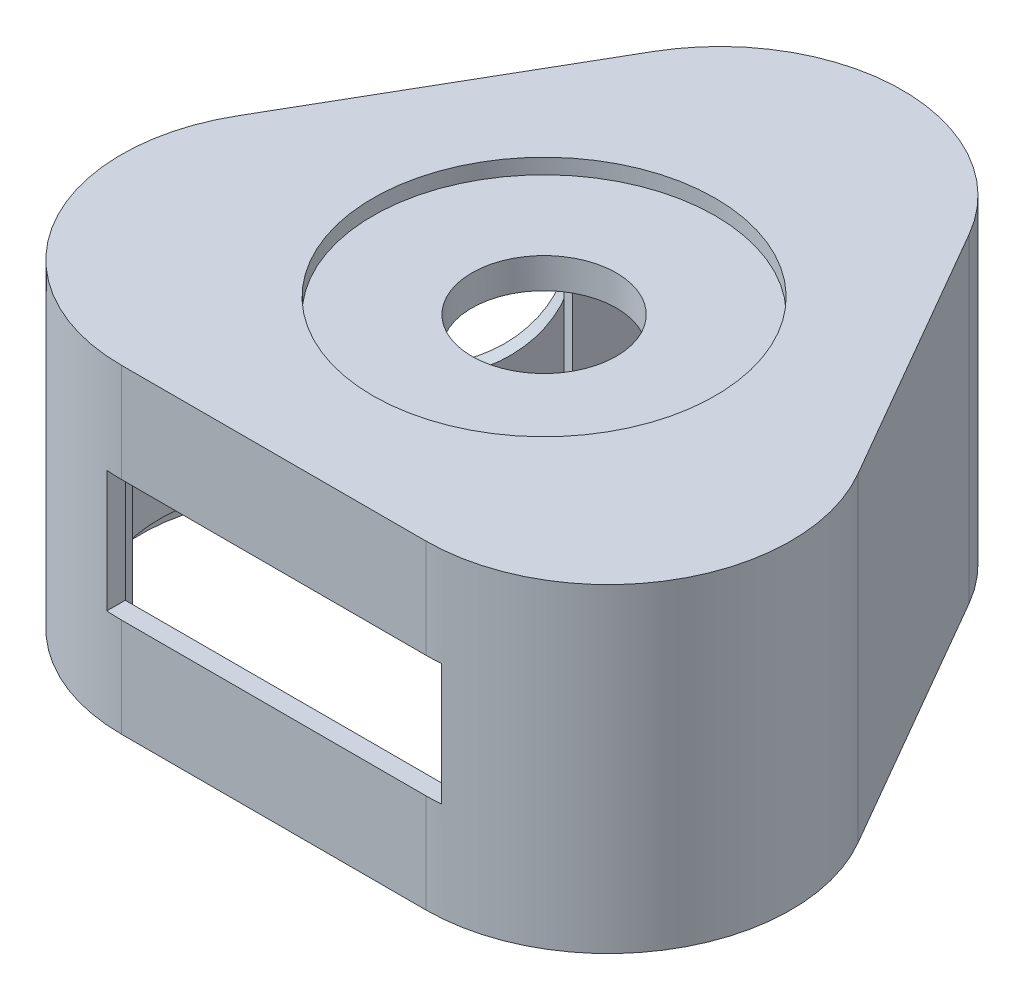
ISO-10303-21;
HEADER;
FILE_DESCRIPTION(('STEP AP214'),'2;1');
FILE_NAME('part.step','',(''),(''),'','','');
FILE_SCHEMA(('AUTOMOTIVE_DESIGN { 1 0 10303 214 1 1 1 1 }'));
ENDSEC;
DATA;
#1=APPLICATION_CONTEXT('core data for automotive mechanical design processes');
#2=APPLICATION_PROTOCOL_DEFINITION('international standard','automotive_design',2000,#1);
#3=PRODUCT_CONTEXT('',#1,'mechanical');
#4=PRODUCT('Part','Part','',(#3));
#5=PRODUCT_RELATED_PRODUCT_CATEGORY('part','',(#4));
#6=PRODUCT_DEFINITION_FORMATION('','',#4);
#7=PRODUCT_DEFINITION_CONTEXT('part definition',#1,'design');
#8=PRODUCT_DEFINITION('design','',#6,#7);
#9=PRODUCT_DEFINITION_SHAPE('','',#8);
#10=(LENGTH_UNIT() NAMED_UNIT(*) SI_UNIT(.MILLI.,.METRE.));
#11=(NAMED_UNIT(*) PLANE_ANGLE_UNIT() SI_UNIT($,.RADIAN.));
#12=(NAMED_UNIT(*) SI_UNIT($,.STERADIAN.) SOLID_ANGLE_UNIT());
#13=UNCERTAINTY_MEASURE_WITH_UNIT(LENGTH_MEASURE(1.E-05),#10,'distance_accuracy_value','');
#14=(GEOMETRIC_REPRESENTATION_CONTEXT(3) GLOBAL_UNCERTAINTY_ASSIGNED_CONTEXT((#13)) GLOBAL_UNIT_ASSIGNED_CONTEXT((#10,
#11,#12)) REPRESENTATION_CONTEXT('',''));
#15=CARTESIAN_POINT('',(0.,0.,0.));
#16=DIRECTION('',(0.,0.,1.));
#17=DIRECTION('',(1.,0.,0.));
#18=AXIS2_PLACEMENT_3D('',#15,#16,#17);
#19=CARTESIAN_POINT('',(0.,18.,-11.5470053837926));
#20=DIRECTION('',(0.,-1.,0.));
#21=DIRECTION('',(0.,0.,-1.));
#22=AXIS2_PLACEMENT_3D('',#19,#20,#21);
#23=PLANE('',#22);
#24=CARTESIAN_POINT('',(0.,18.,0.));
#25=DIRECTION('',(0.,-1.,0.));
#26=DIRECTION('',(0.,0.,-1.));
#27=AXIS2_PLACEMENT_3D('',#24,#25,#26);
#28=CIRCLE('',#27,4.75);
#29=CARTESIAN_POINT('',(0.,18.,-4.75));
#30=VERTEX_POINT('',#29);
#31=EDGE_CURVE('E501',#30,#30,#28,.T.);
#32=ORIENTED_EDGE('',*,*,#31,.F.);
#33=EDGE_LOOP('',(#32));
#34=FACE_BOUND('',#33,.T.);
#35=DIRECTION('',(-0.500000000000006,0.,0.866025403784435));
#36=VECTOR('',#35,1.);
#37=CARTESIAN_POINT('',(-8.22724133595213,18.,-16.2970053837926));
#38=LINE('',#37,#36);
#39=CARTESIAN_POINT('',(-17.2272413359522,18.,-0.708548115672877));
#40=VERTEX_POINT('',#39);
#41=CARTESIAN_POINT('',(-18.2272413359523,18.,1.02350269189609));
#42=VERTEX_POINT('',#41);
#43=EDGE_CURVE('E577',#40,#42,#38,.T.);
#44=ORIENTED_EDGE('',*,*,#43,.F.);
#45=DIRECTION('',(-0.866025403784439,0.,-0.5));
#46=VECTOR('',#45,1.);
#47=CARTESIAN_POINT('',(-17.2272413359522,18.,-0.708548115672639));
#48=LINE('',#47,#46);
#49=CARTESIAN_POINT('',(-10.9052558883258,18.,2.94145188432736));
#50=VERTEX_POINT('',#49);
#51=EDGE_CURVE('E52',#50,#40,#48,.T.);
#52=ORIENTED_EDGE('',*,*,#51,.F.);
#53=DIRECTION('',(-0.5,0.,0.866025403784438));
#54=VECTOR('',#53,1.);
#55=CARTESIAN_POINT('',(-10.9052558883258,18.,2.94145188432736));
#56=LINE('',#55,#54);
#57=CARTESIAN_POINT('',(-8.65525588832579,18.,-0.955662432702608));
#58=VERTEX_POINT('',#57);
#59=EDGE_CURVE('E56',#58,#50,#56,.T.);
#60=ORIENTED_EDGE('',*,*,#59,.F.);
#61=DIRECTION('',(0.866025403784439,0.,0.5));
#62=VECTOR('',#61,1.);
#63=CARTESIAN_POINT('',(-8.65525588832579,18.,-0.95566243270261));
#64=LINE('',#63,#62);
#65=CARTESIAN_POINT('',(-9.95429399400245,18.,-1.70566243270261));
#66=VERTEX_POINT('',#65);
#67=EDGE_CURVE('E1263',#66,#58,#64,.T.);
#68=ORIENTED_EDGE('',*,*,#67,.F.);
#69=DIRECTION('',(0.5,0.,-0.866025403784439));
#70=VECTOR('',#69,1.);
#71=CARTESIAN_POINT('',(-9.95429399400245,18.,-1.70566243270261));
#72=LINE('',#71,#70);
#73=CARTESIAN_POINT('',(-11.3292939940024,18.,0.675907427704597));
#74=VERTEX_POINT('',#73);
#75=EDGE_CURVE('E1266',#74,#66,#72,.T.);
#76=ORIENTED_EDGE('',*,*,#75,.F.);
#77=DIRECTION('',(0.866025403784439,0.,0.499999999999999));
#78=VECTOR('',#77,1.);
#79=CARTESIAN_POINT('',(-11.3292939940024,18.,0.675907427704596));
#80=LINE('',#79,#78);
#81=CARTESIAN_POINT('',(-14.360382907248,18.,-1.0740925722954));
#82=VERTEX_POINT('',#81);
#83=EDGE_CURVE('E1267',#82,#74,#80,.T.);
#84=ORIENTED_EDGE('',*,*,#83,.F.);
#85=DIRECTION('',(-0.499999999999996,0.,0.866025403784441));
#86=VECTOR('',#85,1.);
#87=CARTESIAN_POINT('',(-14.360382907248,18.,-1.0740925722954));
#88=LINE('',#87,#86);
#89=CARTESIAN_POINT('',(-13.985382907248,18.,-1.72361162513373));
#90=VERTEX_POINT('',#89);
#91=EDGE_CURVE('E360',#90,#82,#88,.T.);
#92=ORIENTED_EDGE('',*,*,#91,.F.);
#93=DIRECTION('',(0.86602540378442,0.,0.500000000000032));
#94=VECTOR('',#93,1.);
#95=CARTESIAN_POINT('',(-13.985382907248,18.,-1.72361162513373));
#96=LINE('',#95,#94);
#97=CARTESIAN_POINT('',(-15.9772413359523,18.,-2.87361162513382));
#98=VERTEX_POINT('',#97);
#99=EDGE_CURVE('E357',#98,#90,#96,.T.);
#100=ORIENTED_EDGE('',*,*,#99,.F.);
#101=CARTESIAN_POINT('',(-10.4772413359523,18.,-12.3998910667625));
#102=VERTEX_POINT('',#101);
#103=EDGE_CURVE('E600',#102,#98,#38,.T.);
#104=ORIENTED_EDGE('',*,*,#103,.F.);
#105=DIRECTION('',(-0.866025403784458,0.,-0.499999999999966));
#106=VECTOR('',#105,1.);
#107=CARTESIAN_POINT('',(-8.48538290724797,18.,-11.2498910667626));
#108=LINE('',#107,#106);
#109=CARTESIAN_POINT('',(-8.48538290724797,18.,-11.2498910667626));
#110=VERTEX_POINT('',#109);
#111=EDGE_CURVE('E373',#110,#102,#108,.T.);
#112=ORIENTED_EDGE('',*,*,#111,.F.);
#113=DIRECTION('',(-0.500000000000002,0.,0.866025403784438));
#114=VECTOR('',#113,1.);
#115=CARTESIAN_POINT('',(-8.11038290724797,18.,-11.8994101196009));
#116=LINE('',#115,#114);
#117=CARTESIAN_POINT('',(-8.11038290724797,18.,-11.8994101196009));
#118=VERTEX_POINT('',#117);
#119=EDGE_CURVE('E396',#118,#110,#116,.T.);
#120=ORIENTED_EDGE('',*,*,#119,.F.);
#121=DIRECTION('',(-0.866025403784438,0.,-0.500000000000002));
#122=VECTOR('',#121,1.);
#123=CARTESIAN_POINT('',(-5.07929399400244,18.,-10.1494101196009));
#124=LINE('',#123,#122);
#125=CARTESIAN_POINT('',(-5.07929399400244,18.,-10.1494101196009));
#126=VERTEX_POINT('',#125);
#127=EDGE_CURVE('E394',#126,#118,#124,.T.);
#128=ORIENTED_EDGE('',*,*,#127,.F.);
#129=DIRECTION('',(0.500000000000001,0.,-0.866025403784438));
#130=VECTOR('',#129,1.);
#131=CARTESIAN_POINT('',(-6.45429399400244,18.,-7.76784025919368));
#132=LINE('',#131,#130);
#133=CARTESIAN_POINT('',(-6.45429399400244,18.,-7.76784025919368));
#134=VERTEX_POINT('',#133);
#135=EDGE_CURVE('E392',#134,#126,#132,.T.);
#136=ORIENTED_EDGE('',*,*,#135,.F.);
#137=DIRECTION('',(-0.866025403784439,0.,-0.5));
#138=VECTOR('',#137,1.);
#139=CARTESIAN_POINT('',(-5.15525588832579,18.,-7.01784025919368));
#140=LINE('',#139,#138);
#141=CARTESIAN_POINT('',(-5.15525588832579,18.,-7.01784025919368));
#142=VERTEX_POINT('',#141);
#143=EDGE_CURVE('E390',#142,#134,#140,.T.);
#144=ORIENTED_EDGE('',*,*,#143,.F.);
#145=DIRECTION('',(-0.5,0.,0.866025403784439));
#146=VECTOR('',#145,1.);
#147=CARTESIAN_POINT('',(-2.90525588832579,18.,-10.9149545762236));
#148=LINE('',#147,#146);
#149=CARTESIAN_POINT('',(-2.90525588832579,18.,-10.9149545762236));
#150=VERTEX_POINT('',#149);
#151=EDGE_CURVE('E363',#150,#142,#148,.T.);
#152=ORIENTED_EDGE('',*,*,#151,.F.);
#153=DIRECTION('',(0.866025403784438,0.,0.5));
#154=VECTOR('',#153,1.);
#155=CARTESIAN_POINT('',(-9.22724133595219,18.,-14.5649545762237));
#156=LINE('',#155,#154);
#157=CARTESIAN_POINT('',(-9.22724133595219,18.,-14.5649545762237));
#158=VERTEX_POINT('',#157);
#159=EDGE_CURVE('E361',#158,#150,#156,.T.);
#160=ORIENTED_EDGE('',*,*,#159,.F.);
#161=CARTESIAN_POINT('',(-8.22724133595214,18.,-16.2970053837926));
#162=VERTEX_POINT('',#161);
#163=EDGE_CURVE('E596',#162,#158,#38,.T.);
#164=ORIENTED_EDGE('',*,*,#163,.F.);
#165=CARTESIAN_POINT('',(0.,18.,-11.5470053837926));
#166=DIRECTION('',(0.,-1.,0.));
#167=DIRECTION('',(0.,0.,-1.));
#168=AXIS2_PLACEMENT_3D('',#165,#166,#167);
#169=CIRCLE('',#168,9.50000000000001);
#170=CARTESIAN_POINT('',(8.22724133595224,18.,-16.2970053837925));
#171=VERTEX_POINT('',#170);
#172=EDGE_CURVE('E566',#171,#162,#169,.F.);
#173=ORIENTED_EDGE('',*,*,#172,.F.);
#174=DIRECTION('',(-0.499999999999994,0.,-0.866025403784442));
#175=VECTOR('',#174,1.);
#176=CARTESIAN_POINT('',(18.2272413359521,18.,1.02350269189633));
#177=LINE('',#176,#175);
#178=CARTESIAN_POINT('',(18.2272413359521,18.,1.02350269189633));
#179=VERTEX_POINT('',#178);
#180=EDGE_CURVE('E568',#179,#171,#177,.T.);
#181=ORIENTED_EDGE('',*,*,#180,.F.);
#182=CARTESIAN_POINT('',(9.99999999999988,18.,5.77350269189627));
#183=DIRECTION('',(0.,-1.,0.));
#184=DIRECTION('',(0.,0.,-1.));
#185=AXIS2_PLACEMENT_3D('',#182,#183,#184);
#186=CIRCLE('',#185,9.5);
#187=CARTESIAN_POINT('',(9.99999999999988,18.,15.2735026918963));
#188=VERTEX_POINT('',#187);
#189=EDGE_CURVE('E571',#188,#179,#186,.F.);
#190=ORIENTED_EDGE('',*,*,#189,.F.);
#191=DIRECTION('',(1.,0.,0.));
#192=VECTOR('',#191,1.);
#193=CARTESIAN_POINT('',(-10.0000000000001,18.,15.2735026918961));
#194=LINE('',#193,#192);
#195=CARTESIAN_POINT('',(-10.0000000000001,18.,15.2735026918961));
#196=VERTEX_POINT('',#195);
#197=EDGE_CURVE('E573',#196,#188,#194,.T.);
#198=ORIENTED_EDGE('',*,*,#197,.F.);
#199=CARTESIAN_POINT('',(-10.0000000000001,18.,5.77350269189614));
#200=DIRECTION('',(0.,-1.,0.));
#201=DIRECTION('',(0.,0.,-1.));
#202=AXIS2_PLACEMENT_3D('',#199,#200,#201);
#203=CIRCLE('',#202,9.5);
#204=EDGE_CURVE('E575',#42,#196,#203,.F.);
#205=ORIENTED_EDGE('',*,*,#204,.F.);
#206=EDGE_LOOP('',(#44,#52,#60,#68,#76,#84,#92,#100,#104,#112,#120,#128,#136,#144,#152,#160,
#164,#173,#181,#190,#198,#205));
#207=FACE_BOUND('',#206,.T.);
#208=ADVANCED_FACE('F37',(#34,#207),#23,.T.);
#209=CARTESIAN_POINT('',(-8.22724133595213,74.2933326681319,-16.2970053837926));
#210=DIRECTION('',(-0.866025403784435,0.,-0.500000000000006));
#211=DIRECTION('',(-0.500000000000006,0.,0.866025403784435));
#212=AXIS2_PLACEMENT_3D('',#209,#210,#211);
#213=PLANE('',#212);
#214=DIRECTION('',(0.,1.,0.));
#215=VECTOR('',#214,1.);
#216=CARTESIAN_POINT('',(-15.9772413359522,4.5,-2.87361162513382));
#217=LINE('',#216,#215);
#218=CARTESIAN_POINT('',(-15.9772413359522,11.7,-2.87361162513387));
#219=VERTEX_POINT('',#218);
#220=EDGE_CURVE('E1241',#219,#98,#217,.T.);
#221=ORIENTED_EDGE('',*,*,#220,.F.);
#222=CARTESIAN_POINT('',(-13.2272413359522,11.7,-7.63675134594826));
#223=DIRECTION('',(-0.866025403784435,0.,-0.500000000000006));
#224=DIRECTION('',(-0.500000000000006,0.,0.866025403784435));
#225=AXIS2_PLACEMENT_3D('',#222,#223,#224);
#226=CIRCLE('',#225,5.5);
#227=CARTESIAN_POINT('',(-10.4772413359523,11.7,-12.3998910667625));
#228=VERTEX_POINT('',#227);
#229=EDGE_CURVE('E498',#228,#219,#226,.F.);
#230=ORIENTED_EDGE('',*,*,#229,.F.);
#231=DIRECTION('',(0.,1.,0.));
#232=VECTOR('',#231,1.);
#233=CARTESIAN_POINT('',(-10.4772413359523,4.5,-12.3998910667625));
#234=LINE('',#233,#232);
#235=EDGE_CURVE('E387',#228,#102,#234,.T.);
#236=ORIENTED_EDGE('',*,*,#235,.T.);
#237=ORIENTED_EDGE('',*,*,#103,.T.);
#238=EDGE_LOOP('',(#221,#230,#236,#237));
#239=FACE_BOUND('',#238,.T.);
#240=ADVANCED_FACE('F687',(#239),#213,.F.);
#241=DIRECTION('',(0.,1.,0.));
#242=VECTOR('',#241,1.);
#243=CARTESIAN_POINT('',(-17.2272413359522,4.5,-0.708548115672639));
#244=LINE('',#243,#242);
#245=CARTESIAN_POINT('',(-17.2272413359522,4.5,-0.708548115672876));
#246=VERTEX_POINT('',#245);
#247=EDGE_CURVE('E1252',#246,#40,#244,.T.);
#248=ORIENTED_EDGE('',*,*,#247,.T.);
#249=ORIENTED_EDGE('',*,*,#43,.T.);
#250=DIRECTION('',(0.,-1.,0.));
#251=VECTOR('',#250,1.);
#252=CARTESIAN_POINT('',(-18.2272413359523,74.2933326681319,1.02350269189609));
#253=LINE('',#252,#251);
#254=CARTESIAN_POINT('',(-18.2272413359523,1.5,1.02350269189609));
#255=VERTEX_POINT('',#254);
#256=EDGE_CURVE('E565',#42,#255,#253,.T.);
#257=ORIENTED_EDGE('',*,*,#256,.T.);
#258=DIRECTION('',(-0.500000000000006,0.,0.866025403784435));
#259=VECTOR('',#258,1.);
#260=CARTESIAN_POINT('',(-8.22724133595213,1.5,-16.2970053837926));
#261=LINE('',#260,#259);
#262=CARTESIAN_POINT('',(-8.22724133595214,1.5,-16.2970053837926));
#263=VERTEX_POINT('',#262);
#264=EDGE_CURVE('E648',#263,#255,#261,.T.);
#265=ORIENTED_EDGE('',*,*,#264,.F.);
#266=DIRECTION('',(0.,-1.,0.));
#267=VECTOR('',#266,1.);
#268=CARTESIAN_POINT('',(-8.22724133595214,74.2933326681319,-16.2970053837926));
#269=LINE('',#268,#267);
#270=EDGE_CURVE('E591',#162,#263,#269,.T.);
#271=ORIENTED_EDGE('',*,*,#270,.F.);
#272=ORIENTED_EDGE('',*,*,#163,.T.);
#273=DIRECTION('',(0.,1.,0.));
#274=VECTOR('',#273,1.);
#275=CARTESIAN_POINT('',(-9.22724133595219,4.5,-14.5649545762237));
#276=LINE('',#275,#274);
#277=CARTESIAN_POINT('',(-9.22724133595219,4.5,-14.5649545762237));
#278=VERTEX_POINT('',#277);
#279=EDGE_CURVE('E420',#278,#158,#276,.T.);
#280=ORIENTED_EDGE('',*,*,#279,.F.);
#281=DIRECTION('',(0.500000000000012,0.,-0.866025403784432));
#282=VECTOR('',#281,1.);
#283=CARTESIAN_POINT('',(-10.4772413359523,4.5,-12.3998910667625));
#284=LINE('',#283,#282);
#285=CARTESIAN_POINT('',(-10.4772413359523,4.5,-12.3998910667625));
#286=VERTEX_POINT('',#285);
#287=EDGE_CURVE('E369',#286,#278,#284,.T.);
#288=ORIENTED_EDGE('',*,*,#287,.F.);
#289=EDGE_CURVE('E399',#286,#228,#234,.T.);
#290=ORIENTED_EDGE('',*,*,#289,.T.);
#291=EDGE_CURVE('E502',#219,#228,#226,.F.);
#292=ORIENTED_EDGE('',*,*,#291,.F.);
#293=CARTESIAN_POINT('',(-15.9772413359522,4.5,-2.87361162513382));
#294=VERTEX_POINT('',#293);
#295=EDGE_CURVE('E1246',#294,#219,#217,.T.);
#296=ORIENTED_EDGE('',*,*,#295,.F.);
#297=DIRECTION('',(0.49999999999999,0.,-0.866025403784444));
#298=VECTOR('',#297,1.);
#299=CARTESIAN_POINT('',(-17.2272413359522,4.5,-0.708548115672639));
#300=LINE('',#299,#298);
#301=EDGE_CURVE('E1248',#246,#294,#300,.T.);
#302=ORIENTED_EDGE('',*,*,#301,.F.);
#303=EDGE_LOOP('',(#248,#249,#257,#265,#271,#272,#280,#288,#290,#292,#296,#302));
#304=FACE_BOUND('',#303,.T.);
#305=ADVANCED_FACE('F693',(#304),#213,.F.);
#306=CARTESIAN_POINT('',(-11.0000000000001,6.5,-23.5480053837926));
#307=DIRECTION('',(0.,-1.,0.));
#308=DIRECTION('',(0.,0.,-1.));
#309=AXIS2_PLACEMENT_3D('',#306,#307,#308);
#310=PLANE('',#309);
#311=DIRECTION('',(1.,0.,0.));
#312=VECTOR('',#311,1.);
#313=CARTESIAN_POINT('',(-11.0000000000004,6.5,16.5235026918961));
#314=LINE('',#313,#312);
#315=CARTESIAN_POINT('',(-11.0000000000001,6.5,16.5235026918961));
#316=VERTEX_POINT('',#315);
#317=CARTESIAN_POINT('',(10.9999999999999,6.5,16.5235026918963));
#318=VERTEX_POINT('',#317);
#319=EDGE_CURVE('E449',#316,#318,#314,.T.);
#320=ORIENTED_EDGE('',*,*,#319,.F.);
#321=DIRECTION('',(0.,0.,1.));
#322=VECTOR('',#321,1.);
#323=CARTESIAN_POINT('',(-11.0000000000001,6.5,-23.5480053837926));
#324=LINE('',#323,#322);
#325=CARTESIAN_POINT('',(-11.0000000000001,6.5,17.7317634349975));
#326=VERTEX_POINT('',#325);
#327=EDGE_CURVE('E483',#316,#326,#324,.T.);
#328=ORIENTED_EDGE('',*,*,#327,.T.);
#329=CARTESIAN_POINT('',(-10.0000000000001,6.5,5.77350269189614));
#330=DIRECTION('',(0.,-1.,0.));
#331=DIRECTION('',(0.,0.,-1.));
#332=AXIS2_PLACEMENT_3D('',#329,#330,#331);
#333=CIRCLE('',#332,12.);
#334=CARTESIAN_POINT('',(-10.0000000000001,6.5,17.7735026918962));
#335=VERTEX_POINT('',#334);
#336=EDGE_CURVE('E475',#326,#335,#333,.F.);
#337=ORIENTED_EDGE('',*,*,#336,.T.);
#338=DIRECTION('',(1.,0.,0.));
#339=VECTOR('',#338,1.);
#340=CARTESIAN_POINT('',(-11.0000000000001,6.5,17.7735026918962));
#341=LINE('',#340,#339);
#342=CARTESIAN_POINT('',(9.9999999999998,6.50000000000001,17.7735026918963));
#343=VERTEX_POINT('',#342);
#344=EDGE_CURVE('E463',#335,#343,#341,.T.);
#345=ORIENTED_EDGE('',*,*,#344,.T.);
#346=CARTESIAN_POINT('',(9.99999999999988,6.5,5.77350269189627));
#347=DIRECTION('',(0.,-1.,0.));
#348=DIRECTION('',(0.,0.,-1.));
#349=AXIS2_PLACEMENT_3D('',#346,#347,#348);
#350=CIRCLE('',#349,12.);
#351=CARTESIAN_POINT('',(10.9999999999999,6.5,17.7317634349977));
#352=VERTEX_POINT('',#351);
#353=EDGE_CURVE('E472',#343,#352,#350,.F.);
#354=ORIENTED_EDGE('',*,*,#353,.T.);
#355=DIRECTION('',(0.,0.,1.));
#356=VECTOR('',#355,1.);
#357=CARTESIAN_POINT('',(10.9999999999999,6.5,-23.5480053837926));
#358=LINE('',#357,#356);
#359=EDGE_CURVE('E466',#318,#352,#358,.T.);
#360=ORIENTED_EDGE('',*,*,#359,.F.);
#361=EDGE_LOOP('',(#320,#328,#337,#345,#354,#360));
#362=FACE_BOUND('',#361,.T.);
#363=ADVANCED_FACE('F801',(#362),#310,.F.);
#364=CARTESIAN_POINT('',(10.9999999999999,14.5,-23.5480053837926));
#365=DIRECTION('',(1.,0.,0.));
#366=DIRECTION('',(0.,1.,0.));
#367=AXIS2_PLACEMENT_3D('',#364,#365,#366);
#368=PLANE('',#367);
#369=DIRECTION('',(0.,1.,0.));
#370=VECTOR('',#369,1.);
#371=CARTESIAN_POINT('',(10.9999999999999,14.5,16.5235026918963));
#372=LINE('',#371,#370);
#373=CARTESIAN_POINT('',(10.9999999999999,14.5,16.5235026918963));
#374=VERTEX_POINT('',#373);
#375=EDGE_CURVE('E447',#318,#374,#372,.T.);
#376=ORIENTED_EDGE('',*,*,#375,.F.);
#377=ORIENTED_EDGE('',*,*,#359,.T.);
#378=DIRECTION('',(0.,-1.,0.));
#379=VECTOR('',#378,1.);
#380=CARTESIAN_POINT('',(10.9999999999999,21.,17.7317634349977));
#381=LINE('',#380,#379);
#382=CARTESIAN_POINT('',(10.9999999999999,14.5,17.7317634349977));
#383=VERTEX_POINT('',#382);
#384=EDGE_CURVE('E480',#352,#383,#381,.F.);
#385=ORIENTED_EDGE('',*,*,#384,.T.);
#386=DIRECTION('',(0.,0.,1.));
#387=VECTOR('',#386,1.);
#388=CARTESIAN_POINT('',(10.9999999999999,14.5,-23.5480053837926));
#389=LINE('',#388,#387);
#390=EDGE_CURVE('E488',#374,#383,#389,.T.);
#391=ORIENTED_EDGE('',*,*,#390,.F.);
#392=EDGE_LOOP('',(#376,#377,#385,#391));
#393=FACE_BOUND('',#392,.T.);
#394=ADVANCED_FACE('F797',(#393),#368,.F.);
#395=CARTESIAN_POINT('',(-11.0000000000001,14.5,-23.5480053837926));
#396=DIRECTION('',(0.,1.,0.));
#397=DIRECTION('',(0.,0.,1.));
#398=AXIS2_PLACEMENT_3D('',#395,#396,#397);
#399=PLANE('',#398);
#400=DIRECTION('',(-1.,0.,0.));
#401=VECTOR('',#400,1.);
#402=CARTESIAN_POINT('',(-11.0000000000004,14.5,16.5235026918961));
#403=LINE('',#402,#401);
#404=CARTESIAN_POINT('',(-11.0000000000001,14.5,16.5235026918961));
#405=VERTEX_POINT('',#404);
#406=EDGE_CURVE('E438',#374,#405,#403,.T.);
#407=ORIENTED_EDGE('',*,*,#406,.F.);
#408=ORIENTED_EDGE('',*,*,#390,.T.);
#409=CARTESIAN_POINT('',(9.99999999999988,14.5,5.77350269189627));
#410=DIRECTION('',(0.,1.,0.));
#411=DIRECTION('',(0.,0.,1.));
#412=AXIS2_PLACEMENT_3D('',#409,#410,#411);
#413=CIRCLE('',#412,12.);
#414=CARTESIAN_POINT('',(9.99999999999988,14.5,17.7735026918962));
#415=VERTEX_POINT('',#414);
#416=EDGE_CURVE('E478',#383,#415,#413,.F.);
#417=ORIENTED_EDGE('',*,*,#416,.T.);
#418=DIRECTION('',(-1.,0.,0.));
#419=VECTOR('',#418,1.);
#420=CARTESIAN_POINT('',(-11.0000000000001,14.5,17.7735026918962));
#421=LINE('',#420,#419);
#422=CARTESIAN_POINT('',(-10.0000000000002,14.5,17.7735026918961));
#423=VERTEX_POINT('',#422);
#424=EDGE_CURVE('E464',#415,#423,#421,.T.);
#425=ORIENTED_EDGE('',*,*,#424,.T.);
#426=CARTESIAN_POINT('',(-10.0000000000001,14.5,5.77350269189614));
#427=DIRECTION('',(0.,1.,0.));
#428=DIRECTION('',(0.,0.,1.));
#429=AXIS2_PLACEMENT_3D('',#426,#427,#428);
#430=CIRCLE('',#429,12.);
#431=CARTESIAN_POINT('',(-11.0000000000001,14.5,17.7317634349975));
#432=VERTEX_POINT('',#431);
#433=EDGE_CURVE('E468',#423,#432,#430,.F.);
#434=ORIENTED_EDGE('',*,*,#433,.T.);
#435=DIRECTION('',(0.,0.,1.));
#436=VECTOR('',#435,1.);
#437=CARTESIAN_POINT('',(-11.0000000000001,14.5,-23.5480053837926));
#438=LINE('',#437,#436);
#439=EDGE_CURVE('E486',#405,#432,#438,.T.);
#440=ORIENTED_EDGE('',*,*,#439,.F.);
#441=EDGE_LOOP('',(#407,#408,#417,#425,#434,#440));
#442=FACE_BOUND('',#441,.T.);
#443=ADVANCED_FACE('F792',(#442),#399,.F.);
#444=CARTESIAN_POINT('',(-11.0000000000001,14.5,-23.5480053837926));
#445=DIRECTION('',(-1.,0.,0.));
#446=DIRECTION('',(0.,-1.,0.));
#447=AXIS2_PLACEMENT_3D('',#444,#445,#446);
#448=PLANE('',#447);
#449=DIRECTION('',(0.,-1.,0.));
#450=VECTOR('',#449,1.);
#451=CARTESIAN_POINT('',(-11.0000000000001,14.5,16.5235026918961));
#452=LINE('',#451,#450);
#453=EDGE_CURVE('E650',#405,#316,#452,.T.);
#454=ORIENTED_EDGE('',*,*,#453,.F.);
#455=ORIENTED_EDGE('',*,*,#439,.T.);
#456=DIRECTION('',(0.,-1.,0.));
#457=VECTOR('',#456,1.);
#458=CARTESIAN_POINT('',(-11.0000000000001,21.,17.7317634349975));
#459=LINE('',#458,#457);
#460=EDGE_CURVE('E471',#432,#326,#459,.T.);
#461=ORIENTED_EDGE('',*,*,#460,.T.);
#462=ORIENTED_EDGE('',*,*,#327,.F.);
#463=EDGE_LOOP('',(#454,#455,#461,#462));
#464=FACE_BOUND('',#463,.T.);
#465=ADVANCED_FACE('F806',(#464),#448,.F.);
#466=CARTESIAN_POINT('',(9.9999999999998,21.,17.7735026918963));
#467=DIRECTION('',(0.,0.,-1.));
#468=DIRECTION('',(-1.,0.,0.));
#469=AXIS2_PLACEMENT_3D('',#466,#467,#468);
#470=PLANE('',#469);
#471=DIRECTION('',(0.,-1.,0.));
#472=VECTOR('',#471,1.);
#473=CARTESIAN_POINT('',(9.9999999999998,21.,17.7735026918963));
#474=LINE('',#473,#472);
#475=CARTESIAN_POINT('',(9.9999999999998,0.,17.7735026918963));
#476=VERTEX_POINT('',#475);
#477=EDGE_CURVE('E634',#343,#476,#474,.T.);
#478=ORIENTED_EDGE('',*,*,#477,.F.);
#479=ORIENTED_EDGE('',*,*,#344,.F.);
#480=DIRECTION('',(0.,-1.,0.));
#481=VECTOR('',#480,1.);
#482=CARTESIAN_POINT('',(-10.0000000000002,21.,17.7735026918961));
#483=LINE('',#482,#481);
#484=CARTESIAN_POINT('',(-10.0000000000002,0.,17.7735026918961));
#485=VERTEX_POINT('',#484);
#486=EDGE_CURVE('E638',#335,#485,#483,.T.);
#487=ORIENTED_EDGE('',*,*,#486,.T.);
#488=DIRECTION('',(1.,0.,0.));
#489=VECTOR('',#488,1.);
#490=CARTESIAN_POINT('',(9.9999999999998,0.,17.7735026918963));
#491=LINE('',#490,#489);
#492=EDGE_CURVE('E623',#485,#476,#491,.T.);
#493=ORIENTED_EDGE('',*,*,#492,.T.);
#494=EDGE_LOOP('',(#478,#479,#487,#493));
#495=FACE_BOUND('',#494,.T.);
#496=ADVANCED_FACE('F745',(#495),#470,.F.);
#497=CARTESIAN_POINT('',(-10.0000000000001,74.2933326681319,15.2735026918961));
#498=DIRECTION('',(0.,0.,1.));
#499=DIRECTION('',(1.,0.,0.));
#500=AXIS2_PLACEMENT_3D('',#497,#498,#499);
#501=PLANE('',#500);
#502=DIRECTION('',(0.,-1.,0.));
#503=VECTOR('',#502,1.);
#504=CARTESIAN_POINT('',(-10.0000000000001,74.2933326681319,15.2735026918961));
#505=LINE('',#504,#503);
#506=CARTESIAN_POINT('',(-10.0000000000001,4.5,15.2735026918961));
#507=VERTEX_POINT('',#506);
#508=CARTESIAN_POINT('',(-10.0000000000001,1.5,15.2735026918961));
#509=VERTEX_POINT('',#508);
#510=EDGE_CURVE('E580',#507,#509,#505,.T.);
#511=ORIENTED_EDGE('',*,*,#510,.F.);
#512=DIRECTION('',(1.,0.,0.));
#513=VECTOR('',#512,1.);
#514=CARTESIAN_POINT('',(-10.0000000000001,4.5,15.2735026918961));
#515=LINE('',#514,#513);
#516=CARTESIAN_POINT('',(9.99999999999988,4.5,15.2735026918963));
#517=VERTEX_POINT('',#516);
#518=EDGE_CURVE('E457',#507,#517,#515,.T.);
#519=ORIENTED_EDGE('',*,*,#518,.T.);
#520=DIRECTION('',(0.,-1.,0.));
#521=VECTOR('',#520,1.);
#522=CARTESIAN_POINT('',(9.99999999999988,74.2933326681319,15.2735026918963));
#523=LINE('',#522,#521);
#524=CARTESIAN_POINT('',(9.99999999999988,1.5,15.2735026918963));
#525=VERTEX_POINT('',#524);
#526=EDGE_CURVE('E584',#517,#525,#523,.T.);
#527=ORIENTED_EDGE('',*,*,#526,.T.);
#528=DIRECTION('',(1.,0.,0.));
#529=VECTOR('',#528,1.);
#530=CARTESIAN_POINT('',(-10.0000000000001,1.5,15.2735026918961));
#531=LINE('',#530,#529);
#532=EDGE_CURVE('E559',#509,#525,#531,.T.);
#533=ORIENTED_EDGE('',*,*,#532,.F.);
#534=EDGE_LOOP('',(#511,#519,#527,#533));
#535=FACE_BOUND('',#534,.T.);
#536=ADVANCED_FACE('F707',(#535),#501,.F.);
#537=CARTESIAN_POINT('',(0.,21.,0.));
#538=DIRECTION('',(0.,-1.,0.));
#539=DIRECTION('',(0.,0.,-1.));
#540=AXIS2_PLACEMENT_3D('',#537,#538,#539);
#541=CYLINDRICAL_SURFACE('',#540,4.75);
#542=ORIENTED_EDGE('',*,*,#31,.T.);
#543=EDGE_LOOP('',(#542));
#544=FACE_BOUND('',#543,.T.);
#545=CARTESIAN_POINT('',(0.,20.,0.));
#546=DIRECTION('',(0.,1.,0.));
#547=DIRECTION('',(0.,0.,1.));
#548=AXIS2_PLACEMENT_3D('',#545,#546,#547);
#549=CIRCLE('',#548,4.75);
#550=CARTESIAN_POINT('',(0.,20.,4.75));
#551=VERTEX_POINT('',#550);
#552=EDGE_CURVE('E495',#551,#551,#549,.F.);
#553=ORIENTED_EDGE('',*,*,#552,.F.);
#554=EDGE_LOOP('',(#553));
#555=FACE_BOUND('',#554,.T.);
#556=ADVANCED_FACE('F754',(#544,#555),#541,.F.);
#557=CARTESIAN_POINT('',(0.,21.,-11.5470053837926));
#558=DIRECTION('',(0.,-1.,0.));
#559=DIRECTION('',(0.,0.,-1.));
#560=AXIS2_PLACEMENT_3D('',#557,#558,#559);
#561=CYLINDRICAL_SURFACE('',#560,12.);
#562=CARTESIAN_POINT('',(0.,0.,-11.5470053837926));
#563=DIRECTION('',(0.,1.,0.));
#564=DIRECTION('',(0.,0.,-1.));
#565=AXIS2_PLACEMENT_3D('',#562,#563,#564);
#566=CIRCLE('',#565,12.);
#567=CARTESIAN_POINT('',(10.3923048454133,0.,-17.5470053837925));
#568=VERTEX_POINT('',#567);
#569=CARTESIAN_POINT('',(-10.3923048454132,0.,-17.5470053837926));
#570=VERTEX_POINT('',#569);
#571=EDGE_CURVE('E599',#568,#570,#566,.T.);
#572=ORIENTED_EDGE('',*,*,#571,.T.);
#573=DIRECTION('',(0.,-1.,0.));
#574=VECTOR('',#573,1.);
#575=CARTESIAN_POINT('',(-10.3923048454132,21.,-17.5470053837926));
#576=LINE('',#575,#574);
#577=CARTESIAN_POINT('',(-10.3923048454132,21.,-17.5470053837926));
#578=VERTEX_POINT('',#577);
#579=EDGE_CURVE('E645',#578,#570,#576,.T.);
#580=ORIENTED_EDGE('',*,*,#579,.F.);
#581=CARTESIAN_POINT('',(0.,21.,-11.5470053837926));
#582=DIRECTION('',(0.,1.,0.));
#583=DIRECTION('',(0.,0.,-1.));
#584=AXIS2_PLACEMENT_3D('',#581,#582,#583);
#585=CIRCLE('',#584,12.);
#586=CARTESIAN_POINT('',(10.3923048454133,21.,-17.5470053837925));
#587=VERTEX_POINT('',#586);
#588=EDGE_CURVE('E601',#587,#578,#585,.T.);
#589=ORIENTED_EDGE('',*,*,#588,.F.);
#590=DIRECTION('',(0.,-1.,0.));
#591=VECTOR('',#590,1.);
#592=CARTESIAN_POINT('',(10.3923048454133,21.,-17.5470053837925));
#593=LINE('',#592,#591);
#594=EDGE_CURVE('E615',#587,#568,#593,.T.);
#595=ORIENTED_EDGE('',*,*,#594,.T.);
#596=EDGE_LOOP('',(#572,#580,#589,#595));
#597=FACE_BOUND('',#596,.T.);
#598=ADVANCED_FACE('F751',(#597),#561,.T.);
#599=CARTESIAN_POINT('',(-10.3923048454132,21.,-17.5470053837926));
#600=DIRECTION('',(0.866025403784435,0.,0.500000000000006));
#601=DIRECTION('',(0.500000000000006,0.,-0.866025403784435));
#602=AXIS2_PLACEMENT_3D('',#599,#600,#601);
#603=PLANE('',#602);
#604=CARTESIAN_POINT('',(-15.3923048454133,11.7,-8.88675134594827));
#605=DIRECTION('',(0.866025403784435,0.,0.500000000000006));
#606=DIRECTION('',(0.500000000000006,0.,-0.866025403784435));
#607=AXIS2_PLACEMENT_3D('',#604,#605,#606);
#608=CIRCLE('',#607,6.99999999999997);
#609=CARTESIAN_POINT('',(-11.8923048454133,11.7,-14.9489291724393));
#610=VERTEX_POINT('',#609);
#611=EDGE_CURVE('E12',#610,#610,#608,.T.);
#612=ORIENTED_EDGE('',*,*,#611,.T.);
#613=EDGE_LOOP('',(#612));
#614=FACE_BOUND('',#613,.T.);
#615=DIRECTION('',(-0.500000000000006,0.,0.866025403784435));
#616=VECTOR('',#615,1.);
#617=CARTESIAN_POINT('',(-10.3923048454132,0.,-17.5470053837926));
#618=LINE('',#617,#616);
#619=CARTESIAN_POINT('',(-20.3923048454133,0.,-0.226497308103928));
#620=VERTEX_POINT('',#619);
#621=EDGE_CURVE('E618',#570,#620,#618,.T.);
#622=ORIENTED_EDGE('',*,*,#621,.T.);
#623=DIRECTION('',(0.,-1.,0.));
#624=VECTOR('',#623,1.);
#625=CARTESIAN_POINT('',(-20.3923048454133,21.,-0.226497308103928));
#626=LINE('',#625,#624);
#627=CARTESIAN_POINT('',(-20.3923048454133,21.,-0.226497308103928));
#628=VERTEX_POINT('',#627);
#629=EDGE_CURVE('E642',#628,#620,#626,.T.);
#630=ORIENTED_EDGE('',*,*,#629,.F.);
#631=DIRECTION('',(-0.500000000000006,0.,0.866025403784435));
#632=VECTOR('',#631,1.);
#633=CARTESIAN_POINT('',(-10.3923048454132,21.,-17.5470053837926));
#634=LINE('',#633,#632);
#635=EDGE_CURVE('E604',#578,#628,#634,.T.);
#636=ORIENTED_EDGE('',*,*,#635,.F.);
#637=ORIENTED_EDGE('',*,*,#579,.T.);
#638=EDGE_LOOP('',(#622,#630,#636,#637));
#639=FACE_BOUND('',#638,.T.);
#640=ADVANCED_FACE('F748',(#614,#639),#603,.F.);
#641=CARTESIAN_POINT('',(-10.0000000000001,21.,5.77350269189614));
#642=DIRECTION('',(0.,-1.,0.));
#643=DIRECTION('',(0.,0.,-1.));
#644=AXIS2_PLACEMENT_3D('',#641,#642,#643);
#645=CYLINDRICAL_SURFACE('',#644,12.);
#646=ORIENTED_EDGE('',*,*,#486,.F.);
#647=ORIENTED_EDGE('',*,*,#336,.F.);
#648=ORIENTED_EDGE('',*,*,#460,.F.);
#649=ORIENTED_EDGE('',*,*,#433,.F.);
#650=CARTESIAN_POINT('',(-10.0000000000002,21.,17.7735026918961));
#651=VERTEX_POINT('',#650);
#652=EDGE_CURVE('E639',#651,#423,#483,.T.);
#653=ORIENTED_EDGE('',*,*,#652,.F.);
#654=CARTESIAN_POINT('',(-10.0000000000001,21.,5.77350269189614));
#655=DIRECTION('',(0.,1.,0.));
#656=DIRECTION('',(0.,0.,1.));
#657=AXIS2_PLACEMENT_3D('',#654,#655,#656);
#658=CIRCLE('',#657,12.);
#659=EDGE_CURVE('E607',#628,#651,#658,.T.);
#660=ORIENTED_EDGE('',*,*,#659,.F.);
#661=ORIENTED_EDGE('',*,*,#629,.T.);
#662=CARTESIAN_POINT('',(-10.0000000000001,0.,5.77350269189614));
#663=DIRECTION('',(0.,1.,0.));
#664=DIRECTION('',(0.,0.,1.));
#665=AXIS2_PLACEMENT_3D('',#662,#663,#664);
#666=CIRCLE('',#665,12.);
#667=EDGE_CURVE('E620',#620,#485,#666,.T.);
#668=ORIENTED_EDGE('',*,*,#667,.T.);
#669=EDGE_LOOP('',(#646,#647,#648,#649,#653,#660,#661,#668));
#670=FACE_BOUND('',#669,.T.);
#671=ADVANCED_FACE('F743',(#670),#645,.T.);
#672=ORIENTED_EDGE('',*,*,#652,.T.);
#673=ORIENTED_EDGE('',*,*,#424,.F.);
#674=CARTESIAN_POINT('',(9.9999999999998,21.,17.7735026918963));
#675=VERTEX_POINT('',#674);
#676=EDGE_CURVE('E635',#675,#415,#474,.T.);
#677=ORIENTED_EDGE('',*,*,#676,.F.);
#678=DIRECTION('',(1.,0.,0.));
#679=VECTOR('',#678,1.);
#680=CARTESIAN_POINT('',(9.9999999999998,21.,17.7735026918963));
#681=LINE('',#680,#679);
#682=EDGE_CURVE('E609',#651,#675,#681,.T.);
#683=ORIENTED_EDGE('',*,*,#682,.F.);
#684=EDGE_LOOP('',(#672,#673,#677,#683));
#685=FACE_BOUND('',#684,.T.);
#686=ADVANCED_FACE('F739',(#685),#470,.F.);
#687=CARTESIAN_POINT('',(9.99999999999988,21.,5.77350269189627));
#688=DIRECTION('',(0.,-1.,0.));
#689=DIRECTION('',(0.,0.,-1.));
#690=AXIS2_PLACEMENT_3D('',#687,#688,#689);
#691=CYLINDRICAL_SURFACE('',#690,12.);
#692=ORIENTED_EDGE('',*,*,#384,.F.);
#693=ORIENTED_EDGE('',*,*,#353,.F.);
#694=ORIENTED_EDGE('',*,*,#477,.T.);
#695=CARTESIAN_POINT('',(9.99999999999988,0.,5.77350269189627));
#696=DIRECTION('',(0.,1.,0.));
#697=DIRECTION('',(0.,0.,-1.));
#698=AXIS2_PLACEMENT_3D('',#695,#696,#697);
#699=CIRCLE('',#698,12.);
#700=CARTESIAN_POINT('',(20.3923048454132,0.,-0.226497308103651));
#701=VERTEX_POINT('',#700);
#702=EDGE_CURVE('E626',#476,#701,#699,.T.);
#703=ORIENTED_EDGE('',*,*,#702,.T.);
#704=DIRECTION('',(0.,-1.,0.));
#705=VECTOR('',#704,1.);
#706=CARTESIAN_POINT('',(20.3923048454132,21.,-0.226497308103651));
#707=LINE('',#706,#705);
#708=CARTESIAN_POINT('',(20.3923048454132,21.,-0.226497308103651));
#709=VERTEX_POINT('',#708);
#710=EDGE_CURVE('E631',#709,#701,#707,.T.);
#711=ORIENTED_EDGE('',*,*,#710,.F.);
#712=CARTESIAN_POINT('',(9.99999999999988,21.,5.77350269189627));
#713=DIRECTION('',(0.,1.,0.));
#714=DIRECTION('',(0.,0.,-1.));
#715=AXIS2_PLACEMENT_3D('',#712,#713,#714);
#716=CIRCLE('',#715,12.);
#717=EDGE_CURVE('E611',#675,#709,#716,.T.);
#718=ORIENTED_EDGE('',*,*,#717,.F.);
#719=ORIENTED_EDGE('',*,*,#676,.T.);
#720=ORIENTED_EDGE('',*,*,#416,.F.);
#721=EDGE_LOOP('',(#692,#693,#694,#703,#711,#718,#719,#720));
#722=FACE_BOUND('',#721,.T.);
#723=ADVANCED_FACE('F735',(#722),#691,.T.);
#724=CARTESIAN_POINT('',(10.3923048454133,21.,-17.5470053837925));
#725=DIRECTION('',(-0.866025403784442,0.,0.499999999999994));
#726=DIRECTION('',(0.499999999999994,0.,0.866025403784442));
#727=AXIS2_PLACEMENT_3D('',#724,#725,#726);
#728=PLANE('',#727);
#729=DIRECTION('',(-0.499999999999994,0.,-0.866025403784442));
#730=VECTOR('',#729,1.);
#731=CARTESIAN_POINT('',(10.3923048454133,0.,-17.5470053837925));
#732=LINE('',#731,#730);
#733=EDGE_CURVE('E605',#701,#568,#732,.T.);
#734=ORIENTED_EDGE('',*,*,#733,.T.);
#735=ORIENTED_EDGE('',*,*,#594,.F.);
#736=DIRECTION('',(-0.499999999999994,0.,-0.866025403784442));
#737=VECTOR('',#736,1.);
#738=CARTESIAN_POINT('',(10.3923048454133,21.,-17.5470053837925));
#739=LINE('',#738,#737);
#740=EDGE_CURVE('E613',#709,#587,#739,.T.);
#741=ORIENTED_EDGE('',*,*,#740,.F.);
#742=ORIENTED_EDGE('',*,*,#710,.T.);
#743=EDGE_LOOP('',(#734,#735,#741,#742));
#744=FACE_BOUND('',#743,.T.);
#745=ADVANCED_FACE('F727',(#744),#728,.F.);
#746=CARTESIAN_POINT('',(0.,21.,-11.5470053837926));
#747=DIRECTION('',(0.,-1.,0.));
#748=DIRECTION('',(0.,0.,-1.));
#749=AXIS2_PLACEMENT_3D('',#746,#747,#748);
#750=PLANE('',#749);
#751=CARTESIAN_POINT('',(0.,21.,0.));
#752=DIRECTION('',(0.,1.,0.));
#753=DIRECTION('',(0.,0.,1.));
#754=AXIS2_PLACEMENT_3D('',#751,#752,#753);
#755=CIRCLE('',#754,11.25);
#756=CARTESIAN_POINT('',(0.,21.,11.25));
#757=VERTEX_POINT('',#756);
#758=EDGE_CURVE('E477',#757,#757,#755,.T.);
#759=ORIENTED_EDGE('',*,*,#758,.F.);
#760=EDGE_LOOP('',(#759));
#761=FACE_BOUND('',#760,.T.);
#762=ORIENTED_EDGE('',*,*,#588,.T.);
#763=ORIENTED_EDGE('',*,*,#635,.T.);
#764=ORIENTED_EDGE('',*,*,#659,.T.);
#765=ORIENTED_EDGE('',*,*,#682,.T.);
#766=ORIENTED_EDGE('',*,*,#717,.T.);
#767=ORIENTED_EDGE('',*,*,#740,.T.);
#768=EDGE_LOOP('',(#762,#763,#764,#765,#766,#767));
#769=FACE_BOUND('',#768,.T.);
#770=ADVANCED_FACE('F723',(#761,#769),#750,.F.);
#771=CARTESIAN_POINT('',(0.,0.,-11.5470053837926));
#772=DIRECTION('',(0.,-1.,0.));
#773=DIRECTION('',(0.,0.,-1.));
#774=AXIS2_PLACEMENT_3D('',#771,#772,#773);
#775=PLANE('',#774);
#776=CARTESIAN_POINT('',(0.,0.,-11.5470053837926));
#777=DIRECTION('',(0.,-1.,0.));
#778=DIRECTION('',(0.,0.,-1.));
#779=AXIS2_PLACEMENT_3D('',#776,#777,#778);
#780=CIRCLE('',#779,10.75);
#781=CARTESIAN_POINT('',(-9.30977309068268,0.,-16.9220053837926));
#782=VERTEX_POINT('',#781);
#783=CARTESIAN_POINT('',(9.30977309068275,0.,-16.9220053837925));
#784=VERTEX_POINT('',#783);
#785=EDGE_CURVE('E505',#782,#784,#780,.T.);
#786=ORIENTED_EDGE('',*,*,#785,.F.);
#787=DIRECTION('',(0.500000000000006,0.,-0.866025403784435));
#788=VECTOR('',#787,1.);
#789=CARTESIAN_POINT('',(-19.3097730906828,0.,0.39850269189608));
#790=LINE('',#789,#788);
#791=CARTESIAN_POINT('',(-19.3097730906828,0.,0.398502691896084));
#792=VERTEX_POINT('',#791);
#793=EDGE_CURVE('E510',#792,#782,#790,.T.);
#794=ORIENTED_EDGE('',*,*,#793,.F.);
#795=CARTESIAN_POINT('',(-10.0000000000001,0.,5.77350269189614));
#796=DIRECTION('',(0.,-1.,0.));
#797=DIRECTION('',(0.,0.,-1.));
#798=AXIS2_PLACEMENT_3D('',#795,#796,#797);
#799=CIRCLE('',#798,10.75);
#800=CARTESIAN_POINT('',(-10.0000000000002,0.,16.5235026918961));
#801=VERTEX_POINT('',#800);
#802=EDGE_CURVE('E536',#801,#792,#799,.T.);
#803=ORIENTED_EDGE('',*,*,#802,.F.);
#804=DIRECTION('',(-1.,0.,0.));
#805=VECTOR('',#804,1.);
#806=CARTESIAN_POINT('',(9.99999999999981,0.,16.5235026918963));
#807=LINE('',#806,#805);
#808=CARTESIAN_POINT('',(9.99999999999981,0.,16.5235026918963));
#809=VERTEX_POINT('',#808);
#810=EDGE_CURVE('E533',#809,#801,#807,.T.);
#811=ORIENTED_EDGE('',*,*,#810,.F.);
#812=CARTESIAN_POINT('',(9.99999999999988,0.,5.77350269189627));
#813=DIRECTION('',(0.,-1.,0.));
#814=DIRECTION('',(0.,0.,-1.));
#815=AXIS2_PLACEMENT_3D('',#812,#813,#814);
#816=CIRCLE('',#815,10.75);
#817=CARTESIAN_POINT('',(19.3097730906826,0.,0.398502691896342));
#818=VERTEX_POINT('',#817);
#819=EDGE_CURVE('E530',#818,#809,#816,.T.);
#820=ORIENTED_EDGE('',*,*,#819,.F.);
#821=DIRECTION('',(0.499999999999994,0.,0.866025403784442));
#822=VECTOR('',#821,1.);
#823=CARTESIAN_POINT('',(9.30977309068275,0.,-16.9220053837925));
#824=LINE('',#823,#822);
#825=EDGE_CURVE('E527',#784,#818,#824,.T.);
#826=ORIENTED_EDGE('',*,*,#825,.F.);
#827=EDGE_LOOP('',(#786,#794,#803,#811,#820,#826));
#828=FACE_BOUND('',#827,.T.);
#829=ORIENTED_EDGE('',*,*,#571,.F.);
#830=ORIENTED_EDGE('',*,*,#733,.F.);
#831=ORIENTED_EDGE('',*,*,#702,.F.);
#832=ORIENTED_EDGE('',*,*,#492,.F.);
#833=ORIENTED_EDGE('',*,*,#667,.F.);
#834=ORIENTED_EDGE('',*,*,#621,.F.);
#835=EDGE_LOOP('',(#829,#830,#831,#832,#833,#834));
#836=FACE_BOUND('',#835,.T.);
#837=ADVANCED_FACE('F726',(#828,#836),#775,.T.);
#838=CARTESIAN_POINT('',(0.,1.5,-11.5470053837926));
#839=DIRECTION('',(0.,-1.,0.));
#840=DIRECTION('',(0.,0.,-1.));
#841=AXIS2_PLACEMENT_3D('',#838,#839,#840);
#842=PLANE('',#841);
#843=CARTESIAN_POINT('',(0.,1.5,-11.5470053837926));
#844=DIRECTION('',(0.,-1.,0.));
#845=DIRECTION('',(0.,0.,-1.));
#846=AXIS2_PLACEMENT_3D('',#843,#844,#845);
#847=CIRCLE('',#846,10.75);
#848=CARTESIAN_POINT('',(-9.30977309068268,1.5,-16.9220053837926));
#849=VERTEX_POINT('',#848);
#850=CARTESIAN_POINT('',(9.30977309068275,1.5,-16.9220053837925));
#851=VERTEX_POINT('',#850);
#852=EDGE_CURVE('E506',#849,#851,#847,.T.);
#853=ORIENTED_EDGE('',*,*,#852,.T.);
#854=DIRECTION('',(0.499999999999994,0.,0.866025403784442));
#855=VECTOR('',#854,1.);
#856=CARTESIAN_POINT('',(9.30977309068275,1.5,-16.9220053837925));
#857=LINE('',#856,#855);
#858=CARTESIAN_POINT('',(19.3097730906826,1.5,0.398502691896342));
#859=VERTEX_POINT('',#858);
#860=EDGE_CURVE('E509',#851,#859,#857,.T.);
#861=ORIENTED_EDGE('',*,*,#860,.T.);
#862=CARTESIAN_POINT('',(9.99999999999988,1.5,5.77350269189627));
#863=DIRECTION('',(0.,-1.,0.));
#864=DIRECTION('',(0.,0.,-1.));
#865=AXIS2_PLACEMENT_3D('',#862,#863,#864);
#866=CIRCLE('',#865,10.75);
#867=CARTESIAN_POINT('',(9.99999999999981,1.5,16.5235026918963));
#868=VERTEX_POINT('',#867);
#869=EDGE_CURVE('E513',#859,#868,#866,.T.);
#870=ORIENTED_EDGE('',*,*,#869,.T.);
#871=DIRECTION('',(-1.,0.,0.));
#872=VECTOR('',#871,1.);
#873=CARTESIAN_POINT('',(9.99999999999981,1.5,16.5235026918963));
#874=LINE('',#873,#872);
#875=CARTESIAN_POINT('',(-10.0000000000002,1.5,16.5235026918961));
#876=VERTEX_POINT('',#875);
#877=EDGE_CURVE('E516',#868,#876,#874,.T.);
#878=ORIENTED_EDGE('',*,*,#877,.T.);
#879=CARTESIAN_POINT('',(-10.0000000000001,1.5,5.77350269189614));
#880=DIRECTION('',(0.,-1.,0.));
#881=DIRECTION('',(0.,0.,-1.));
#882=AXIS2_PLACEMENT_3D('',#879,#880,#881);
#883=CIRCLE('',#882,10.75);
#884=CARTESIAN_POINT('',(-19.3097730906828,1.5,0.398502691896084));
#885=VERTEX_POINT('',#884);
#886=EDGE_CURVE('E519',#876,#885,#883,.T.);
#887=ORIENTED_EDGE('',*,*,#886,.T.);
#888=DIRECTION('',(0.500000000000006,0.,-0.866025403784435));
#889=VECTOR('',#888,1.);
#890=CARTESIAN_POINT('',(-19.3097730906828,1.5,0.39850269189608));
#891=LINE('',#890,#889);
#892=EDGE_CURVE('E522',#885,#849,#891,.T.);
#893=ORIENTED_EDGE('',*,*,#892,.T.);
#894=EDGE_LOOP('',(#853,#861,#870,#878,#887,#893));
#895=FACE_BOUND('',#894,.T.);
#896=CARTESIAN_POINT('',(-10.0000000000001,1.5,5.77350269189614));
#897=DIRECTION('',(0.,-1.,0.));
#898=DIRECTION('',(0.,0.,-1.));
#899=AXIS2_PLACEMENT_3D('',#896,#897,#898);
#900=CIRCLE('',#899,9.5);
#901=EDGE_CURVE('E562',#255,#509,#900,.F.);
#902=ORIENTED_EDGE('',*,*,#901,.T.);
#903=ORIENTED_EDGE('',*,*,#532,.T.);
#904=CARTESIAN_POINT('',(9.99999999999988,1.5,5.77350269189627));
#905=DIRECTION('',(0.,-1.,0.));
#906=DIRECTION('',(0.,0.,-1.));
#907=AXIS2_PLACEMENT_3D('',#904,#905,#906);
#908=CIRCLE('',#907,9.5);
#909=CARTESIAN_POINT('',(18.2272413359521,1.5,1.02350269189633));
#910=VERTEX_POINT('',#909);
#911=EDGE_CURVE('E557',#525,#910,#908,.F.);
#912=ORIENTED_EDGE('',*,*,#911,.T.);
#913=DIRECTION('',(-0.499999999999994,0.,-0.866025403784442));
#914=VECTOR('',#913,1.);
#915=CARTESIAN_POINT('',(18.2272413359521,1.5,1.02350269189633));
#916=LINE('',#915,#914);
#917=CARTESIAN_POINT('',(8.22724133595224,1.5,-16.2970053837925));
#918=VERTEX_POINT('',#917);
#919=EDGE_CURVE('E555',#910,#918,#916,.T.);
#920=ORIENTED_EDGE('',*,*,#919,.T.);
#921=CARTESIAN_POINT('',(0.,1.5,-11.5470053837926));
#922=DIRECTION('',(0.,-1.,0.));
#923=DIRECTION('',(0.,0.,-1.));
#924=AXIS2_PLACEMENT_3D('',#921,#922,#923);
#925=CIRCLE('',#924,9.50000000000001);
#926=EDGE_CURVE('E543',#918,#263,#925,.F.);
#927=ORIENTED_EDGE('',*,*,#926,.T.);
#928=ORIENTED_EDGE('',*,*,#264,.T.);
#929=EDGE_LOOP('',(#902,#903,#912,#920,#927,#928));
#930=FACE_BOUND('',#929,.T.);
#931=ADVANCED_FACE('F731',(#895,#930),#842,.T.);
#932=CARTESIAN_POINT('',(0.,1.5,-11.5470053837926));
#933=DIRECTION('',(0.,-1.,0.));
#934=DIRECTION('',(0.,0.,-1.));
#935=AXIS2_PLACEMENT_3D('',#932,#933,#934);
#936=CYLINDRICAL_SURFACE('',#935,10.75);
#937=ORIENTED_EDGE('',*,*,#785,.T.);
#938=DIRECTION('',(0.,-1.,0.));
#939=VECTOR('',#938,1.);
#940=CARTESIAN_POINT('',(9.30977309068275,1.5,-16.9220053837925));
#941=LINE('',#940,#939);
#942=EDGE_CURVE('E525',#851,#784,#941,.T.);
#943=ORIENTED_EDGE('',*,*,#942,.F.);
#944=ORIENTED_EDGE('',*,*,#852,.F.);
#945=DIRECTION('',(0.,-1.,0.));
#946=VECTOR('',#945,1.);
#947=CARTESIAN_POINT('',(-9.30977309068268,1.5,-16.9220053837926));
#948=LINE('',#947,#946);
#949=EDGE_CURVE('E541',#849,#782,#948,.T.);
#950=ORIENTED_EDGE('',*,*,#949,.T.);
#951=EDGE_LOOP('',(#937,#943,#944,#950));
#952=FACE_BOUND('',#951,.T.);
#953=ADVANCED_FACE('F699',(#952),#936,.F.);
#954=CARTESIAN_POINT('',(-19.3097730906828,1.5,0.39850269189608));
#955=DIRECTION('',(-0.866025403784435,0.,-0.500000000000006));
#956=DIRECTION('',(-0.500000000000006,0.,0.866025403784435));
#957=AXIS2_PLACEMENT_3D('',#954,#955,#956);
#958=PLANE('',#957);
#959=ORIENTED_EDGE('',*,*,#793,.T.);
#960=ORIENTED_EDGE('',*,*,#949,.F.);
#961=ORIENTED_EDGE('',*,*,#892,.F.);
#962=DIRECTION('',(0.,-1.,0.));
#963=VECTOR('',#962,1.);
#964=CARTESIAN_POINT('',(-19.3097730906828,1.5,0.398502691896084));
#965=LINE('',#964,#963);
#966=EDGE_CURVE('E544',#885,#792,#965,.T.);
#967=ORIENTED_EDGE('',*,*,#966,.T.);
#968=EDGE_LOOP('',(#959,#960,#961,#967));
#969=FACE_BOUND('',#968,.T.);
#970=ADVANCED_FACE('F832',(#969),#958,.F.);
#971=CARTESIAN_POINT('',(-10.0000000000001,1.5,5.77350269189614));
#972=DIRECTION('',(0.,-1.,0.));
#973=DIRECTION('',(0.,0.,-1.));
#974=AXIS2_PLACEMENT_3D('',#971,#972,#973);
#975=CYLINDRICAL_SURFACE('',#974,10.75);
#976=ORIENTED_EDGE('',*,*,#802,.T.);
#977=ORIENTED_EDGE('',*,*,#966,.F.);
#978=ORIENTED_EDGE('',*,*,#886,.F.);
#979=DIRECTION('',(0.,-1.,0.));
#980=VECTOR('',#979,1.);
#981=CARTESIAN_POINT('',(-10.0000000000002,1.5,16.5235026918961));
#982=LINE('',#981,#980);
#983=EDGE_CURVE('E546',#876,#801,#982,.T.);
#984=ORIENTED_EDGE('',*,*,#983,.T.);
#985=EDGE_LOOP('',(#976,#977,#978,#984));
#986=FACE_BOUND('',#985,.T.);
#987=ADVANCED_FACE('F835',(#986),#975,.F.);
#988=CARTESIAN_POINT('',(9.99999999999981,1.5,16.5235026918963));
#989=DIRECTION('',(0.,0.,1.));
#990=DIRECTION('',(1.,0.,0.));
#991=AXIS2_PLACEMENT_3D('',#988,#989,#990);
#992=PLANE('',#991);
#993=ORIENTED_EDGE('',*,*,#810,.T.);
#994=ORIENTED_EDGE('',*,*,#983,.F.);
#995=ORIENTED_EDGE('',*,*,#877,.F.);
#996=DIRECTION('',(0.,-1.,0.));
#997=VECTOR('',#996,1.);
#998=CARTESIAN_POINT('',(9.99999999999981,1.5,16.5235026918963));
#999=LINE('',#998,#997);
#1000=EDGE_CURVE('E548',#868,#809,#999,.T.);
#1001=ORIENTED_EDGE('',*,*,#1000,.T.);
#1002=EDGE_LOOP('',(#993,#994,#995,#1001));
#1003=FACE_BOUND('',#1002,.T.);
#1004=ADVANCED_FACE('F839',(#1003),#992,.F.);
#1005=CARTESIAN_POINT('',(9.99999999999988,1.5,5.77350269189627));
#1006=DIRECTION('',(0.,-1.,0.));
#1007=DIRECTION('',(0.,0.,-1.));
#1008=AXIS2_PLACEMENT_3D('',#1005,#1006,#1007);
#1009=CYLINDRICAL_SURFACE('',#1008,10.75);
#1010=ORIENTED_EDGE('',*,*,#819,.T.);
#1011=ORIENTED_EDGE('',*,*,#1000,.F.);
#1012=ORIENTED_EDGE('',*,*,#869,.F.);
#1013=DIRECTION('',(0.,-1.,0.));
#1014=VECTOR('',#1013,1.);
#1015=CARTESIAN_POINT('',(19.3097730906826,1.5,0.398502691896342));
#1016=LINE('',#1015,#1014);
#1017=EDGE_CURVE('E550',#859,#818,#1016,.T.);
#1018=ORIENTED_EDGE('',*,*,#1017,.T.);
#1019=EDGE_LOOP('',(#1010,#1011,#1012,#1018));
#1020=FACE_BOUND('',#1019,.T.);
#1021=ADVANCED_FACE('F843',(#1020),#1009,.F.);
#1022=CARTESIAN_POINT('',(9.30977309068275,1.5,-16.9220053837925));
#1023=DIRECTION('',(0.866025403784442,0.,-0.499999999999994));
#1024=DIRECTION('',(-0.499999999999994,0.,-0.866025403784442));
#1025=AXIS2_PLACEMENT_3D('',#1022,#1023,#1024);
#1026=PLANE('',#1025);
#1027=ORIENTED_EDGE('',*,*,#825,.T.);
#1028=ORIENTED_EDGE('',*,*,#1017,.F.);
#1029=ORIENTED_EDGE('',*,*,#860,.F.);
#1030=ORIENTED_EDGE('',*,*,#942,.T.);
#1031=EDGE_LOOP('',(#1027,#1028,#1029,#1030));
#1032=FACE_BOUND('',#1031,.T.);
#1033=ADVANCED_FACE('F717',(#1032),#1026,.F.);
#1034=CARTESIAN_POINT('',(0.,74.2933326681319,-11.5470053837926));
#1035=DIRECTION('',(0.,-1.,0.));
#1036=DIRECTION('',(0.,0.,-1.));
#1037=AXIS2_PLACEMENT_3D('',#1034,#1035,#1036);
#1038=CYLINDRICAL_SURFACE('',#1037,9.50000000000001);
#1039=ORIENTED_EDGE('',*,*,#926,.F.);
#1040=DIRECTION('',(0.,-1.,0.));
#1041=VECTOR('',#1040,1.);
#1042=CARTESIAN_POINT('',(8.22724133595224,74.2933326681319,-16.2970053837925));
#1043=LINE('',#1042,#1041);
#1044=EDGE_CURVE('E588',#171,#918,#1043,.T.);
#1045=ORIENTED_EDGE('',*,*,#1044,.F.);
#1046=ORIENTED_EDGE('',*,*,#172,.T.);
#1047=ORIENTED_EDGE('',*,*,#270,.T.);
#1048=EDGE_LOOP('',(#1039,#1045,#1046,#1047));
#1049=FACE_BOUND('',#1048,.T.);
#1050=ADVANCED_FACE('F714',(#1049),#1038,.F.);
#1051=CARTESIAN_POINT('',(18.2272413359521,74.2933326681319,1.02350269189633));
#1052=DIRECTION('',(0.866025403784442,0.,-0.499999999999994));
#1053=DIRECTION('',(-0.499999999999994,0.,-0.866025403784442));
#1054=AXIS2_PLACEMENT_3D('',#1051,#1052,#1053);
#1055=PLANE('',#1054);
#1056=ORIENTED_EDGE('',*,*,#919,.F.);
#1057=DIRECTION('',(0.,-1.,0.));
#1058=VECTOR('',#1057,1.);
#1059=CARTESIAN_POINT('',(18.2272413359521,74.2933326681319,1.02350269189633));
#1060=LINE('',#1059,#1058);
#1061=EDGE_CURVE('E585',#179,#910,#1060,.T.);
#1062=ORIENTED_EDGE('',*,*,#1061,.F.);
#1063=ORIENTED_EDGE('',*,*,#180,.T.);
#1064=ORIENTED_EDGE('',*,*,#1044,.T.);
#1065=EDGE_LOOP('',(#1056,#1062,#1063,#1064));
#1066=FACE_BOUND('',#1065,.T.);
#1067=ADVANCED_FACE('F710',(#1066),#1055,.F.);
#1068=CARTESIAN_POINT('',(9.99999999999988,74.2933326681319,5.77350269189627));
#1069=DIRECTION('',(0.,-1.,0.));
#1070=DIRECTION('',(0.,0.,-1.));
#1071=AXIS2_PLACEMENT_3D('',#1068,#1069,#1070);
#1072=CYLINDRICAL_SURFACE('',#1071,9.5);
#1073=ORIENTED_EDGE('',*,*,#526,.F.);
#1074=CARTESIAN_POINT('',(9.99999999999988,4.5,5.77350269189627));
#1075=DIRECTION('',(0.,-1.,0.));
#1076=DIRECTION('',(1.,0.,0.));
#1077=AXIS2_PLACEMENT_3D('',#1074,#1075,#1076);
#1078=CIRCLE('',#1077,9.5);
#1079=CARTESIAN_POINT('',(11.9999999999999,4.5,15.0605905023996));
#1080=VERTEX_POINT('',#1079);
#1081=EDGE_CURVE('E460',#517,#1080,#1078,.F.);
#1082=ORIENTED_EDGE('',*,*,#1081,.T.);
#1083=DIRECTION('',(0.,-1.,0.));
#1084=VECTOR('',#1083,1.);
#1085=CARTESIAN_POINT('',(11.9999999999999,74.2933326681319,15.0605905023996));
#1086=LINE('',#1085,#1084);
#1087=CARTESIAN_POINT('',(11.9999999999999,15.5,15.0605905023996));
#1088=VERTEX_POINT('',#1087);
#1089=EDGE_CURVE('E663',#1080,#1088,#1086,.F.);
#1090=ORIENTED_EDGE('',*,*,#1089,.T.);
#1091=CARTESIAN_POINT('',(9.99999999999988,15.5,5.77350269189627));
#1092=DIRECTION('',(0.,1.,0.));
#1093=DIRECTION('',(-1.,0.,0.));
#1094=AXIS2_PLACEMENT_3D('',#1091,#1092,#1093);
#1095=CIRCLE('',#1094,9.5);
#1096=CARTESIAN_POINT('',(9.99999999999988,15.5,15.2735026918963));
#1097=VERTEX_POINT('',#1096);
#1098=EDGE_CURVE('E454',#1088,#1097,#1095,.F.);
#1099=ORIENTED_EDGE('',*,*,#1098,.T.);
#1100=EDGE_CURVE('E581',#188,#1097,#523,.T.);
#1101=ORIENTED_EDGE('',*,*,#1100,.F.);
#1102=ORIENTED_EDGE('',*,*,#189,.T.);
#1103=ORIENTED_EDGE('',*,*,#1061,.T.);
#1104=ORIENTED_EDGE('',*,*,#911,.F.);
#1105=EDGE_LOOP('',(#1073,#1082,#1090,#1099,#1101,#1102,#1103,#1104));
#1106=FACE_BOUND('',#1105,.T.);
#1107=ADVANCED_FACE('F705',(#1106),#1072,.F.);
#1108=ORIENTED_EDGE('',*,*,#1100,.T.);
#1109=DIRECTION('',(-1.,0.,0.));
#1110=VECTOR('',#1109,1.);
#1111=CARTESIAN_POINT('',(-10.0000000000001,15.5,15.2735026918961));
#1112=LINE('',#1111,#1110);
#1113=CARTESIAN_POINT('',(-10.0000000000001,15.5,15.2735026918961));
#1114=VERTEX_POINT('',#1113);
#1115=EDGE_CURVE('E451',#1097,#1114,#1112,.T.);
#1116=ORIENTED_EDGE('',*,*,#1115,.T.);
#1117=EDGE_CURVE('E569',#196,#1114,#505,.T.);
#1118=ORIENTED_EDGE('',*,*,#1117,.F.);
#1119=ORIENTED_EDGE('',*,*,#197,.T.);
#1120=EDGE_LOOP('',(#1108,#1116,#1118,#1119));
#1121=FACE_BOUND('',#1120,.T.);
#1122=ADVANCED_FACE('F701',(#1121),#501,.F.);
#1123=CARTESIAN_POINT('',(-10.0000000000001,74.2933326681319,5.77350269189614));
#1124=DIRECTION('',(0.,-1.,0.));
#1125=DIRECTION('',(0.,0.,-1.));
#1126=AXIS2_PLACEMENT_3D('',#1123,#1124,#1125);
#1127=CYLINDRICAL_SURFACE('',#1126,9.5);
#1128=DIRECTION('',(0.,-1.,0.));
#1129=VECTOR('',#1128,1.);
#1130=CARTESIAN_POINT('',(-12.0000000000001,74.2933326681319,15.0605905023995));
#1131=LINE('',#1130,#1129);
#1132=CARTESIAN_POINT('',(-12.0000000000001,15.5,15.0605905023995));
#1133=VERTEX_POINT('',#1132);
#1134=CARTESIAN_POINT('',(-12.0000000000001,4.5,15.0605905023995));
#1135=VERTEX_POINT('',#1134);
#1136=EDGE_CURVE('E657',#1133,#1135,#1131,.T.);
#1137=ORIENTED_EDGE('',*,*,#1136,.T.);
#1138=CARTESIAN_POINT('',(-10.0000000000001,4.5,5.77350269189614));
#1139=DIRECTION('',(0.,-1.,0.));
#1140=DIRECTION('',(1.,0.,0.));
#1141=AXIS2_PLACEMENT_3D('',#1138,#1139,#1140);
#1142=CIRCLE('',#1141,9.5);
#1143=EDGE_CURVE('E660',#1135,#507,#1142,.F.);
#1144=ORIENTED_EDGE('',*,*,#1143,.T.);
#1145=ORIENTED_EDGE('',*,*,#510,.T.);
#1146=ORIENTED_EDGE('',*,*,#901,.F.);
#1147=ORIENTED_EDGE('',*,*,#256,.F.);
#1148=ORIENTED_EDGE('',*,*,#204,.T.);
#1149=ORIENTED_EDGE('',*,*,#1117,.T.);
#1150=CARTESIAN_POINT('',(-10.0000000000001,15.5,5.77350269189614));
#1151=DIRECTION('',(0.,1.,0.));
#1152=DIRECTION('',(-1.,0.,0.));
#1153=AXIS2_PLACEMENT_3D('',#1150,#1151,#1152);
#1154=CIRCLE('',#1153,9.5);
#1155=EDGE_CURVE('E654',#1114,#1133,#1154,.F.);
#1156=ORIENTED_EDGE('',*,*,#1155,.T.);
#1157=EDGE_LOOP('',(#1137,#1144,#1145,#1146,#1147,#1148,#1149,#1156));
#1158=FACE_BOUND('',#1157,.T.);
#1159=ADVANCED_FACE('F704',(#1158),#1127,.F.);
#1160=CARTESIAN_POINT('',(24.1973354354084,11.7,13.9703381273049));
#1161=DIRECTION('',(-0.866025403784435,0.,-0.500000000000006));
#1162=DIRECTION('',(-0.500000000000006,0.,0.866025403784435));
#1163=AXIS2_PLACEMENT_3D('',#1160,#1161,#1162);
#1164=CYLINDRICAL_SURFACE('',#1163,5.5);
#1165=CARTESIAN_POINT('',(-14.0932667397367,11.7,-8.1367513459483));
#1166=DIRECTION('',(0.866025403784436,0.,0.500000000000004));
#1167=DIRECTION('',(0.500000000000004,0.,-0.866025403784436));
#1168=AXIS2_PLACEMENT_3D('',#1165,#1166,#1167);
#1169=CIRCLE('',#1168,5.5);
#1170=CARTESIAN_POINT('',(-11.3432667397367,11.7,-12.8998910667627));
#1171=VERTEX_POINT('',#1170);
#1172=EDGE_CURVE('E45',#1171,#1171,#1169,.F.);
#1173=ORIENTED_EDGE('',*,*,#1172,.T.);
#1174=EDGE_LOOP('',(#1173));
#1175=FACE_BOUND('',#1174,.T.);
#1176=ORIENTED_EDGE('',*,*,#229,.T.);
#1177=ORIENTED_EDGE('',*,*,#291,.T.);
#1178=EDGE_LOOP('',(#1176,#1177));
#1179=FACE_BOUND('',#1178,.T.);
#1180=ADVANCED_FACE('F668',(#1175,#1179),#1164,.F.);
#1181=CARTESIAN_POINT('',(0.,20.,0.));
#1182=DIRECTION('',(0.,1.,0.));
#1183=DIRECTION('',(0.,0.,1.));
#1184=AXIS2_PLACEMENT_3D('',#1181,#1182,#1183);
#1185=PLANE('',#1184);
#1186=CARTESIAN_POINT('',(0.,20.,0.));
#1187=DIRECTION('',(0.,1.,0.));
#1188=DIRECTION('',(0.,0.,1.));
#1189=AXIS2_PLACEMENT_3D('',#1186,#1187,#1188);
#1190=CIRCLE('',#1189,11.25);
#1191=CARTESIAN_POINT('',(0.,20.,11.25));
#1192=VERTEX_POINT('',#1191);
#1193=EDGE_CURVE('E492',#1192,#1192,#1190,.T.);
#1194=ORIENTED_EDGE('',*,*,#1193,.T.);
#1195=EDGE_LOOP('',(#1194));
#1196=FACE_BOUND('',#1195,.T.);
#1197=ORIENTED_EDGE('',*,*,#552,.T.);
#1198=EDGE_LOOP('',(#1197));
#1199=FACE_BOUND('',#1198,.T.);
#1200=ADVANCED_FACE('F818',(#1196,#1199),#1185,.T.);
#1201=CARTESIAN_POINT('',(0.,20.,0.));
#1202=DIRECTION('',(0.,1.,0.));
#1203=DIRECTION('',(0.,0.,1.));
#1204=AXIS2_PLACEMENT_3D('',#1201,#1202,#1203);
#1205=CYLINDRICAL_SURFACE('',#1204,11.25);
#1206=ORIENTED_EDGE('',*,*,#1193,.F.);
#1207=EDGE_LOOP('',(#1206));
#1208=FACE_BOUND('',#1207,.T.);
#1209=ORIENTED_EDGE('',*,*,#758,.T.);
#1210=EDGE_LOOP('',(#1209));
#1211=FACE_BOUND('',#1210,.T.);
#1212=ADVANCED_FACE('F821',(#1208,#1211),#1205,.F.);
#1213=CARTESIAN_POINT('',(11.9999999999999,4.5,16.5235026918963));
#1214=DIRECTION('',(1.,0.,0.));
#1215=DIRECTION('',(0.,0.,-1.));
#1216=AXIS2_PLACEMENT_3D('',#1213,#1214,#1215);
#1217=PLANE('',#1216);
#1218=DIRECTION('',(0.,0.,-1.));
#1219=VECTOR('',#1218,1.);
#1220=CARTESIAN_POINT('',(11.9999999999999,4.5,16.5235026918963));
#1221=LINE('',#1220,#1219);
#1222=CARTESIAN_POINT('',(11.9999999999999,4.5,16.5235026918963));
#1223=VERTEX_POINT('',#1222);
#1224=EDGE_CURVE('E439',#1223,#1080,#1221,.T.);
#1225=ORIENTED_EDGE('',*,*,#1224,.F.);
#1226=DIRECTION('',(0.,-1.,0.));
#1227=VECTOR('',#1226,1.);
#1228=CARTESIAN_POINT('',(11.9999999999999,4.5,16.5235026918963));
#1229=LINE('',#1228,#1227);
#1230=CARTESIAN_POINT('',(11.9999999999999,15.5,16.5235026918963));
#1231=VERTEX_POINT('',#1230);
#1232=EDGE_CURVE('E428',#1231,#1223,#1229,.T.);
#1233=ORIENTED_EDGE('',*,*,#1232,.F.);
#1234=DIRECTION('',(0.,0.,-1.));
#1235=VECTOR('',#1234,1.);
#1236=CARTESIAN_POINT('',(11.9999999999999,15.5,16.5235026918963));
#1237=LINE('',#1236,#1235);
#1238=EDGE_CURVE('E442',#1231,#1088,#1237,.T.);
#1239=ORIENTED_EDGE('',*,*,#1238,.T.);
#1240=ORIENTED_EDGE('',*,*,#1089,.F.);
#1241=EDGE_LOOP('',(#1225,#1233,#1239,#1240));
#1242=FACE_BOUND('',#1241,.T.);
#1243=ADVANCED_FACE('F825',(#1242),#1217,.F.);
#1244=CARTESIAN_POINT('',(-12.0000000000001,4.5,16.5235026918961));
#1245=DIRECTION('',(-1.,0.,0.));
#1246=DIRECTION('',(0.,0.,1.));
#1247=AXIS2_PLACEMENT_3D('',#1244,#1245,#1246);
#1248=PLANE('',#1247);
#1249=DIRECTION('',(0.,0.,-1.));
#1250=VECTOR('',#1249,1.);
#1251=CARTESIAN_POINT('',(-12.0000000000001,15.5,16.5235026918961));
#1252=LINE('',#1251,#1250);
#1253=CARTESIAN_POINT('',(-12.0000000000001,15.5,16.5235026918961));
#1254=VERTEX_POINT('',#1253);
#1255=EDGE_CURVE('E434',#1254,#1133,#1252,.T.);
#1256=ORIENTED_EDGE('',*,*,#1255,.F.);
#1257=DIRECTION('',(0.,1.,0.));
#1258=VECTOR('',#1257,1.);
#1259=CARTESIAN_POINT('',(-12.0000000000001,4.5,16.5235026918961));
#1260=LINE('',#1259,#1258);
#1261=CARTESIAN_POINT('',(-12.0000000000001,4.5,16.5235026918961));
#1262=VERTEX_POINT('',#1261);
#1263=EDGE_CURVE('E422',#1262,#1254,#1260,.T.);
#1264=ORIENTED_EDGE('',*,*,#1263,.F.);
#1265=DIRECTION('',(0.,0.,-1.));
#1266=VECTOR('',#1265,1.);
#1267=CARTESIAN_POINT('',(-12.0000000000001,4.5,16.5235026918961));
#1268=LINE('',#1267,#1266);
#1269=EDGE_CURVE('E435',#1262,#1135,#1268,.T.);
#1270=ORIENTED_EDGE('',*,*,#1269,.T.);
#1271=ORIENTED_EDGE('',*,*,#1136,.F.);
#1272=EDGE_LOOP('',(#1256,#1264,#1270,#1271));
#1273=FACE_BOUND('',#1272,.T.);
#1274=ADVANCED_FACE('F1015',(#1273),#1248,.F.);
#1275=CARTESIAN_POINT('',(-12.0000000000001,4.5,16.5235026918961));
#1276=DIRECTION('',(0.,-1.,0.));
#1277=DIRECTION('',(1.,0.,0.));
#1278=AXIS2_PLACEMENT_3D('',#1275,#1276,#1277);
#1279=PLANE('',#1278);
#1280=ORIENTED_EDGE('',*,*,#518,.F.);
#1281=ORIENTED_EDGE('',*,*,#1143,.F.);
#1282=ORIENTED_EDGE('',*,*,#1269,.F.);
#1283=DIRECTION('',(-1.,0.,0.));
#1284=VECTOR('',#1283,1.);
#1285=CARTESIAN_POINT('',(-12.0000000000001,4.5,16.5235026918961));
#1286=LINE('',#1285,#1284);
#1287=EDGE_CURVE('E431',#1223,#1262,#1286,.T.);
#1288=ORIENTED_EDGE('',*,*,#1287,.F.);
#1289=ORIENTED_EDGE('',*,*,#1224,.T.);
#1290=ORIENTED_EDGE('',*,*,#1081,.F.);
#1291=EDGE_LOOP('',(#1280,#1281,#1282,#1288,#1289,#1290));
#1292=FACE_BOUND('',#1291,.T.);
#1293=ADVANCED_FACE('F1025',(#1292),#1279,.F.);
#1294=CARTESIAN_POINT('',(-12.0000000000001,15.5,16.5235026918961));
#1295=DIRECTION('',(0.,1.,0.));
#1296=DIRECTION('',(-1.,0.,0.));
#1297=AXIS2_PLACEMENT_3D('',#1294,#1295,#1296);
#1298=PLANE('',#1297);
#1299=ORIENTED_EDGE('',*,*,#1238,.F.);
#1300=DIRECTION('',(1.,0.,0.));
#1301=VECTOR('',#1300,1.);
#1302=CARTESIAN_POINT('',(-12.0000000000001,15.5,16.5235026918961));
#1303=LINE('',#1302,#1301);
#1304=EDGE_CURVE('E425',#1254,#1231,#1303,.T.);
#1305=ORIENTED_EDGE('',*,*,#1304,.F.);
#1306=ORIENTED_EDGE('',*,*,#1255,.T.);
#1307=ORIENTED_EDGE('',*,*,#1155,.F.);
#1308=ORIENTED_EDGE('',*,*,#1115,.F.);
#1309=ORIENTED_EDGE('',*,*,#1098,.F.);
#1310=EDGE_LOOP('',(#1299,#1305,#1306,#1307,#1308,#1309));
#1311=FACE_BOUND('',#1310,.T.);
#1312=ADVANCED_FACE('F682',(#1311),#1298,.F.);
#1313=CARTESIAN_POINT('',(-1.12230049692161E-13,0.,16.5235026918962));
#1314=DIRECTION('',(0.,0.,-1.));
#1315=DIRECTION('',(-1.,0.,0.));
#1316=AXIS2_PLACEMENT_3D('',#1313,#1314,#1315);
#1317=PLANE('',#1316);
#1318=ORIENTED_EDGE('',*,*,#1263,.T.);
#1319=ORIENTED_EDGE('',*,*,#1304,.T.);
#1320=ORIENTED_EDGE('',*,*,#1232,.T.);
#1321=ORIENTED_EDGE('',*,*,#1287,.T.);
#1322=EDGE_LOOP('',(#1318,#1319,#1320,#1321));
#1323=FACE_BOUND('',#1322,.T.);
#1324=ORIENTED_EDGE('',*,*,#319,.T.);
#1325=ORIENTED_EDGE('',*,*,#375,.T.);
#1326=ORIENTED_EDGE('',*,*,#406,.T.);
#1327=ORIENTED_EDGE('',*,*,#453,.T.);
#1328=EDGE_LOOP('',(#1324,#1325,#1326,#1327));
#1329=FACE_BOUND('',#1328,.T.);
#1330=ADVANCED_FACE('F673',(#1323,#1329),#1317,.T.);
#1331=CARTESIAN_POINT('',(-14.0932667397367,11.7,-8.1367513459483));
#1332=DIRECTION('',(-0.866025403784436,0.,-0.500000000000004));
#1333=DIRECTION('',(-0.500000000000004,0.,0.866025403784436));
#1334=AXIS2_PLACEMENT_3D('',#1331,#1332,#1333);
#1335=CONICAL_SURFACE('',#1334,5.5,0.785398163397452);
#1336=ORIENTED_EDGE('',*,*,#611,.F.);
#1337=EDGE_LOOP('',(#1336));
#1338=FACE_BOUND('',#1337,.T.);
#1339=ORIENTED_EDGE('',*,*,#1172,.F.);
#1340=EDGE_LOOP('',(#1339));
#1341=FACE_BOUND('',#1340,.T.);
#1342=ADVANCED_FACE('F39',(#1338,#1341),#1335,.F.);
#1343=CARTESIAN_POINT('',(-9.22724133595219,4.5,-14.5649545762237));
#1344=DIRECTION('',(-0.5,0.,0.866025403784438));
#1345=DIRECTION('',(0.866025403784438,0.,0.5));
#1346=AXIS2_PLACEMENT_3D('',#1343,#1344,#1345);
#1347=PLANE('',#1346);
#1348=ORIENTED_EDGE('',*,*,#159,.T.);
#1349=DIRECTION('',(0.,1.,0.));
#1350=VECTOR('',#1349,1.);
#1351=CARTESIAN_POINT('',(-2.90525588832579,4.5,-10.9149545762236));
#1352=LINE('',#1351,#1350);
#1353=CARTESIAN_POINT('',(-2.90525588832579,4.5,-10.9149545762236));
#1354=VERTEX_POINT('',#1353);
#1355=EDGE_CURVE('E417',#1354,#150,#1352,.T.);
#1356=ORIENTED_EDGE('',*,*,#1355,.F.);
#1357=DIRECTION('',(0.866025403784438,0.,0.5));
#1358=VECTOR('',#1357,1.);
#1359=CARTESIAN_POINT('',(-9.22724133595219,4.5,-14.5649545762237));
#1360=LINE('',#1359,#1358);
#1361=EDGE_CURVE('E372',#278,#1354,#1360,.T.);
#1362=ORIENTED_EDGE('',*,*,#1361,.F.);
#1363=ORIENTED_EDGE('',*,*,#279,.T.);
#1364=EDGE_LOOP('',(#1348,#1356,#1362,#1363));
#1365=FACE_BOUND('',#1364,.T.);
#1366=ADVANCED_FACE('F672',(#1365),#1347,.F.);
#1367=CARTESIAN_POINT('',(-2.90525588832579,4.5,-10.9149545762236));
#1368=DIRECTION('',(-0.866025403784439,0.,-0.5));
#1369=DIRECTION('',(-0.5,0.,0.866025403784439));
#1370=AXIS2_PLACEMENT_3D('',#1367,#1368,#1369);
#1371=PLANE('',#1370);
#1372=ORIENTED_EDGE('',*,*,#151,.T.);
#1373=DIRECTION('',(0.,1.,0.));
#1374=VECTOR('',#1373,1.);
#1375=CARTESIAN_POINT('',(-5.15525588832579,4.5,-7.01784025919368));
#1376=LINE('',#1375,#1374);
#1377=CARTESIAN_POINT('',(-5.15525588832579,4.5,-7.01784025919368));
#1378=VERTEX_POINT('',#1377);
#1379=EDGE_CURVE('E414',#1378,#142,#1376,.T.);
#1380=ORIENTED_EDGE('',*,*,#1379,.F.);
#1381=DIRECTION('',(-0.5,0.,0.866025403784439));
#1382=VECTOR('',#1381,1.);
#1383=CARTESIAN_POINT('',(-2.90525588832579,4.5,-10.9149545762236));
#1384=LINE('',#1383,#1382);
#1385=EDGE_CURVE('E375',#1354,#1378,#1384,.T.);
#1386=ORIENTED_EDGE('',*,*,#1385,.F.);
#1387=ORIENTED_EDGE('',*,*,#1355,.T.);
#1388=EDGE_LOOP('',(#1372,#1380,#1386,#1387));
#1389=FACE_BOUND('',#1388,.T.);
#1390=ADVANCED_FACE('F679',(#1389),#1371,.F.);
#1391=CARTESIAN_POINT('',(-5.15525588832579,4.5,-7.01784025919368));
#1392=DIRECTION('',(0.5,0.,-0.866025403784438));
#1393=DIRECTION('',(-0.866025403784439,0.,-0.5));
#1394=AXIS2_PLACEMENT_3D('',#1391,#1392,#1393);
#1395=PLANE('',#1394);
#1396=ORIENTED_EDGE('',*,*,#143,.T.);
#1397=DIRECTION('',(0.,1.,0.));
#1398=VECTOR('',#1397,1.);
#1399=CARTESIAN_POINT('',(-6.45429399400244,4.5,-7.76784025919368));
#1400=LINE('',#1399,#1398);
#1401=CARTESIAN_POINT('',(-6.45429399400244,4.5,-7.76784025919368));
#1402=VERTEX_POINT('',#1401);
#1403=EDGE_CURVE('E411',#1402,#134,#1400,.T.);
#1404=ORIENTED_EDGE('',*,*,#1403,.F.);
#1405=DIRECTION('',(-0.866025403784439,0.,-0.5));
#1406=VECTOR('',#1405,1.);
#1407=CARTESIAN_POINT('',(-5.15525588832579,4.5,-7.01784025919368));
#1408=LINE('',#1407,#1406);
#1409=EDGE_CURVE('E377',#1378,#1402,#1408,.T.);
#1410=ORIENTED_EDGE('',*,*,#1409,.F.);
#1411=ORIENTED_EDGE('',*,*,#1379,.T.);
#1412=EDGE_LOOP('',(#1396,#1404,#1410,#1411));
#1413=FACE_BOUND('',#1412,.T.);
#1414=ADVANCED_FACE('F1099',(#1413),#1395,.F.);
#1415=CARTESIAN_POINT('',(-6.45429399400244,4.5,-7.76784025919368));
#1416=DIRECTION('',(0.866025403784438,0.,0.500000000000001));
#1417=DIRECTION('',(0.500000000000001,0.,-0.866025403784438));
#1418=AXIS2_PLACEMENT_3D('',#1415,#1416,#1417);
#1419=PLANE('',#1418);
#1420=ORIENTED_EDGE('',*,*,#135,.T.);
#1421=DIRECTION('',(0.,1.,0.));
#1422=VECTOR('',#1421,1.);
#1423=CARTESIAN_POINT('',(-5.07929399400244,4.5,-10.1494101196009));
#1424=LINE('',#1423,#1422);
#1425=CARTESIAN_POINT('',(-5.07929399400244,4.5,-10.1494101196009));
#1426=VERTEX_POINT('',#1425);
#1427=EDGE_CURVE('E408',#1426,#126,#1424,.T.);
#1428=ORIENTED_EDGE('',*,*,#1427,.F.);
#1429=DIRECTION('',(0.500000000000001,0.,-0.866025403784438));
#1430=VECTOR('',#1429,1.);
#1431=CARTESIAN_POINT('',(-6.45429399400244,4.5,-7.76784025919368));
#1432=LINE('',#1431,#1430);
#1433=EDGE_CURVE('E379',#1402,#1426,#1432,.T.);
#1434=ORIENTED_EDGE('',*,*,#1433,.F.);
#1435=ORIENTED_EDGE('',*,*,#1403,.T.);
#1436=EDGE_LOOP('',(#1420,#1428,#1434,#1435));
#1437=FACE_BOUND('',#1436,.T.);
#1438=ADVANCED_FACE('F1109',(#1437),#1419,.F.);
#1439=CARTESIAN_POINT('',(-5.07929399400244,4.5,-10.1494101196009));
#1440=DIRECTION('',(0.500000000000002,0.,-0.866025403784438));
#1441=DIRECTION('',(-0.866025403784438,0.,-0.500000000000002));
#1442=AXIS2_PLACEMENT_3D('',#1439,#1440,#1441);
#1443=PLANE('',#1442);
#1444=ORIENTED_EDGE('',*,*,#127,.T.);
#1445=DIRECTION('',(0.,1.,0.));
#1446=VECTOR('',#1445,1.);
#1447=CARTESIAN_POINT('',(-8.11038290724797,4.5,-11.8994101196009));
#1448=LINE('',#1447,#1446);
#1449=CARTESIAN_POINT('',(-8.11038290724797,4.5,-11.8994101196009));
#1450=VERTEX_POINT('',#1449);
#1451=EDGE_CURVE('E405',#1450,#118,#1448,.T.);
#1452=ORIENTED_EDGE('',*,*,#1451,.F.);
#1453=DIRECTION('',(-0.866025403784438,0.,-0.500000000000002));
#1454=VECTOR('',#1453,1.);
#1455=CARTESIAN_POINT('',(-5.07929399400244,4.5,-10.1494101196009));
#1456=LINE('',#1455,#1454);
#1457=EDGE_CURVE('E381',#1426,#1450,#1456,.T.);
#1458=ORIENTED_EDGE('',*,*,#1457,.F.);
#1459=ORIENTED_EDGE('',*,*,#1427,.T.);
#1460=EDGE_LOOP('',(#1444,#1452,#1458,#1459));
#1461=FACE_BOUND('',#1460,.T.);
#1462=ADVANCED_FACE('F1119',(#1461),#1443,.F.);
#1463=CARTESIAN_POINT('',(-8.11038290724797,4.5,-11.8994101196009));
#1464=DIRECTION('',(-0.866025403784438,0.,-0.500000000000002));
#1465=DIRECTION('',(-0.500000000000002,0.,0.866025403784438));
#1466=AXIS2_PLACEMENT_3D('',#1463,#1464,#1465);
#1467=PLANE('',#1466);
#1468=ORIENTED_EDGE('',*,*,#119,.T.);
#1469=DIRECTION('',(0.,1.,0.));
#1470=VECTOR('',#1469,1.);
#1471=CARTESIAN_POINT('',(-8.48538290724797,4.5,-11.2498910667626));
#1472=LINE('',#1471,#1470);
#1473=CARTESIAN_POINT('',(-8.48538290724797,4.5,-11.2498910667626));
#1474=VERTEX_POINT('',#1473);
#1475=EDGE_CURVE('E402',#1474,#110,#1472,.T.);
#1476=ORIENTED_EDGE('',*,*,#1475,.F.);
#1477=DIRECTION('',(-0.500000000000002,0.,0.866025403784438));
#1478=VECTOR('',#1477,1.);
#1479=CARTESIAN_POINT('',(-8.11038290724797,4.5,-11.8994101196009));
#1480=LINE('',#1479,#1478);
#1481=EDGE_CURVE('E383',#1450,#1474,#1480,.T.);
#1482=ORIENTED_EDGE('',*,*,#1481,.F.);
#1483=ORIENTED_EDGE('',*,*,#1451,.T.);
#1484=EDGE_LOOP('',(#1468,#1476,#1482,#1483));
#1485=FACE_BOUND('',#1484,.T.);
#1486=ADVANCED_FACE('F1129',(#1485),#1467,.F.);
#1487=CARTESIAN_POINT('',(-8.48538290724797,4.5,-11.2498910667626));
#1488=DIRECTION('',(0.499999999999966,0.,-0.866025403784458));
#1489=DIRECTION('',(-0.866025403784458,0.,-0.499999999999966));
#1490=AXIS2_PLACEMENT_3D('',#1487,#1488,#1489);
#1491=PLANE('',#1490);
#1492=ORIENTED_EDGE('',*,*,#111,.T.);
#1493=ORIENTED_EDGE('',*,*,#235,.F.);
#1494=ORIENTED_EDGE('',*,*,#289,.F.);
#1495=DIRECTION('',(-0.866025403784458,0.,-0.499999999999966));
#1496=VECTOR('',#1495,1.);
#1497=CARTESIAN_POINT('',(-8.48538290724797,4.5,-11.2498910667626));
#1498=LINE('',#1497,#1496);
#1499=EDGE_CURVE('E385',#1474,#286,#1498,.T.);
#1500=ORIENTED_EDGE('',*,*,#1499,.F.);
#1501=ORIENTED_EDGE('',*,*,#1475,.T.);
#1502=EDGE_LOOP('',(#1492,#1493,#1494,#1500,#1501));
#1503=FACE_BOUND('',#1502,.T.);
#1504=ADVANCED_FACE('F1139',(#1503),#1491,.F.);
#1505=CARTESIAN_POINT('',(0.,4.5,0.));
#1506=DIRECTION('',(0.,-1.,0.));
#1507=DIRECTION('',(0.,0.,-1.));
#1508=AXIS2_PLACEMENT_3D('',#1505,#1506,#1507);
#1509=PLANE('',#1508);
#1510=ORIENTED_EDGE('',*,*,#287,.T.);
#1511=ORIENTED_EDGE('',*,*,#1361,.T.);
#1512=ORIENTED_EDGE('',*,*,#1385,.T.);
#1513=ORIENTED_EDGE('',*,*,#1409,.T.);
#1514=ORIENTED_EDGE('',*,*,#1433,.T.);
#1515=ORIENTED_EDGE('',*,*,#1457,.T.);
#1516=ORIENTED_EDGE('',*,*,#1481,.T.);
#1517=ORIENTED_EDGE('',*,*,#1499,.T.);
#1518=EDGE_LOOP('',(#1510,#1511,#1512,#1513,#1514,#1515,#1516,#1517));
#1519=FACE_BOUND('',#1518,.T.);
#1520=ADVANCED_FACE('F1149',(#1519),#1509,.T.);
#1521=CARTESIAN_POINT('',(-14.360382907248,4.5,-1.0740925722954));
#1522=DIRECTION('',(-0.866025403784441,0.,-0.499999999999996));
#1523=DIRECTION('',(-0.499999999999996,0.,0.866025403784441));
#1524=AXIS2_PLACEMENT_3D('',#1521,#1522,#1523);
#1525=PLANE('',#1524);
#1526=ORIENTED_EDGE('',*,*,#91,.T.);
#1527=DIRECTION('',(0.,1.,0.));
#1528=VECTOR('',#1527,1.);
#1529=CARTESIAN_POINT('',(-14.360382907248,4.5,-1.0740925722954));
#1530=LINE('',#1529,#1528);
#1531=CARTESIAN_POINT('',(-14.360382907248,4.5,-1.0740925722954));
#1532=VERTEX_POINT('',#1531);
#1533=EDGE_CURVE('E340',#1532,#82,#1530,.T.);
#1534=ORIENTED_EDGE('',*,*,#1533,.F.);
#1535=DIRECTION('',(-0.499999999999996,0.,0.866025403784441));
#1536=VECTOR('',#1535,1.);
#1537=CARTESIAN_POINT('',(-14.360382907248,4.5,-1.0740925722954));
#1538=LINE('',#1537,#1536);
#1539=CARTESIAN_POINT('',(-13.985382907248,4.5,-1.72361162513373));
#1540=VERTEX_POINT('',#1539);
#1541=EDGE_CURVE('E347',#1540,#1532,#1538,.T.);
#1542=ORIENTED_EDGE('',*,*,#1541,.F.);
#1543=DIRECTION('',(0.,1.,0.));
#1544=VECTOR('',#1543,1.);
#1545=CARTESIAN_POINT('',(-13.985382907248,4.5,-1.72361162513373));
#1546=LINE('',#1545,#1544);
#1547=EDGE_CURVE('E1239',#1540,#90,#1546,.T.);
#1548=ORIENTED_EDGE('',*,*,#1547,.T.);
#1549=EDGE_LOOP('',(#1526,#1534,#1542,#1548));
#1550=FACE_BOUND('',#1549,.T.);
#1551=ADVANCED_FACE('F359',(#1550),#1525,.F.);
#1552=CARTESIAN_POINT('',(-11.3292939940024,4.5,0.675907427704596));
#1553=DIRECTION('',(-0.499999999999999,0.,0.866025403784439));
#1554=DIRECTION('',(0.866025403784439,0.,0.499999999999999));
#1555=AXIS2_PLACEMENT_3D('',#1552,#1553,#1554);
#1556=PLANE('',#1555);
#1557=ORIENTED_EDGE('',*,*,#83,.T.);
#1558=DIRECTION('',(0.,1.,0.));
#1559=VECTOR('',#1558,1.);
#1560=CARTESIAN_POINT('',(-11.3292939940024,4.5,0.675907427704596));
#1561=LINE('',#1560,#1559);
#1562=CARTESIAN_POINT('',(-11.3292939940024,4.5,0.675907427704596));
#1563=VERTEX_POINT('',#1562);
#1564=EDGE_CURVE('E343',#1563,#74,#1561,.T.);
#1565=ORIENTED_EDGE('',*,*,#1564,.F.);
#1566=DIRECTION('',(0.866025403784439,0.,0.499999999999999));
#1567=VECTOR('',#1566,1.);
#1568=CARTESIAN_POINT('',(-11.3292939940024,4.5,0.675907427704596));
#1569=LINE('',#1568,#1567);
#1570=EDGE_CURVE('E335',#1532,#1563,#1569,.T.);
#1571=ORIENTED_EDGE('',*,*,#1570,.F.);
#1572=ORIENTED_EDGE('',*,*,#1533,.T.);
#1573=EDGE_LOOP('',(#1557,#1565,#1571,#1572));
#1574=FACE_BOUND('',#1573,.T.);
#1575=ADVANCED_FACE('F338',(#1574),#1556,.F.);
#1576=CARTESIAN_POINT('',(-9.95429399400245,4.5,-1.70566243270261));
#1577=DIRECTION('',(0.866025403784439,0.,0.499999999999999));
#1578=DIRECTION('',(0.5,0.,-0.866025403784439));
#1579=AXIS2_PLACEMENT_3D('',#1576,#1577,#1578);
#1580=PLANE('',#1579);
#1581=ORIENTED_EDGE('',*,*,#75,.T.);
#1582=DIRECTION('',(0.,1.,0.));
#1583=VECTOR('',#1582,1.);
#1584=CARTESIAN_POINT('',(-9.95429399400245,4.5,-1.70566243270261));
#1585=LINE('',#1584,#1583);
#1586=CARTESIAN_POINT('',(-9.95429399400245,4.5,-1.70566243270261));
#1587=VERTEX_POINT('',#1586);
#1588=EDGE_CURVE('E365',#1587,#66,#1585,.T.);
#1589=ORIENTED_EDGE('',*,*,#1588,.F.);
#1590=DIRECTION('',(0.5,0.,-0.866025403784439));
#1591=VECTOR('',#1590,1.);
#1592=CARTESIAN_POINT('',(-9.95429399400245,4.5,-1.70566243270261));
#1593=LINE('',#1592,#1591);
#1594=EDGE_CURVE('E346',#1563,#1587,#1593,.T.);
#1595=ORIENTED_EDGE('',*,*,#1594,.F.);
#1596=ORIENTED_EDGE('',*,*,#1564,.T.);
#1597=EDGE_LOOP('',(#1581,#1589,#1595,#1596));
#1598=FACE_BOUND('',#1597,.T.);
#1599=ADVANCED_FACE('F1176',(#1598),#1580,.F.);
#1600=CARTESIAN_POINT('',(-8.65525588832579,4.5,-0.95566243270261));
#1601=DIRECTION('',(-0.5,0.,0.866025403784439));
#1602=DIRECTION('',(0.866025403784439,0.,0.5));
#1603=AXIS2_PLACEMENT_3D('',#1600,#1601,#1602);
#1604=PLANE('',#1603);
#1605=ORIENTED_EDGE('',*,*,#67,.T.);
#1606=DIRECTION('',(0.,1.,0.));
#1607=VECTOR('',#1606,1.);
#1608=CARTESIAN_POINT('',(-8.65525588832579,4.5,-0.95566243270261));
#1609=LINE('',#1608,#1607);
#1610=CARTESIAN_POINT('',(-8.65525588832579,4.5,-0.95566243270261));
#1611=VERTEX_POINT('',#1610);
#1612=EDGE_CURVE('E1257',#1611,#58,#1609,.T.);
#1613=ORIENTED_EDGE('',*,*,#1612,.F.);
#1614=DIRECTION('',(0.866025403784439,0.,0.5));
#1615=VECTOR('',#1614,1.);
#1616=CARTESIAN_POINT('',(-8.65525588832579,4.5,-0.95566243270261));
#1617=LINE('',#1616,#1615);
#1618=EDGE_CURVE('E1264',#1587,#1611,#1617,.T.);
#1619=ORIENTED_EDGE('',*,*,#1618,.F.);
#1620=ORIENTED_EDGE('',*,*,#1588,.T.);
#1621=EDGE_LOOP('',(#1605,#1613,#1619,#1620));
#1622=FACE_BOUND('',#1621,.T.);
#1623=ADVANCED_FACE('F1185',(#1622),#1604,.F.);
#1624=CARTESIAN_POINT('',(-10.9052558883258,4.5,2.94145188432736));
#1625=DIRECTION('',(-0.866025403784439,0.,-0.5));
#1626=DIRECTION('',(-0.5,0.,0.866025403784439));
#1627=AXIS2_PLACEMENT_3D('',#1624,#1625,#1626);
#1628=PLANE('',#1627);
#1629=ORIENTED_EDGE('',*,*,#59,.T.);
#1630=DIRECTION('',(0.,1.,0.));
#1631=VECTOR('',#1630,1.);
#1632=CARTESIAN_POINT('',(-10.9052558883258,4.5,2.94145188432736));
#1633=LINE('',#1632,#1631);
#1634=CARTESIAN_POINT('',(-10.9052558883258,4.5,2.94145188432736));
#1635=VERTEX_POINT('',#1634);
#1636=EDGE_CURVE('E1254',#1635,#50,#1633,.T.);
#1637=ORIENTED_EDGE('',*,*,#1636,.F.);
#1638=DIRECTION('',(-0.5,0.,0.866025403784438));
#1639=VECTOR('',#1638,1.);
#1640=CARTESIAN_POINT('',(-10.9052558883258,4.5,2.94145188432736));
#1641=LINE('',#1640,#1639);
#1642=EDGE_CURVE('E1279',#1611,#1635,#1641,.T.);
#1643=ORIENTED_EDGE('',*,*,#1642,.F.);
#1644=ORIENTED_EDGE('',*,*,#1612,.T.);
#1645=EDGE_LOOP('',(#1629,#1637,#1643,#1644));
#1646=FACE_BOUND('',#1645,.T.);
#1647=ADVANCED_FACE('F1195',(#1646),#1628,.F.);
#1648=CARTESIAN_POINT('',(-17.2272413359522,4.5,-0.708548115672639));
#1649=DIRECTION('',(0.5,0.,-0.866025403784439));
#1650=DIRECTION('',(-0.866025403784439,0.,-0.5));
#1651=AXIS2_PLACEMENT_3D('',#1648,#1649,#1650);
#1652=PLANE('',#1651);
#1653=ORIENTED_EDGE('',*,*,#51,.T.);
#1654=ORIENTED_EDGE('',*,*,#247,.F.);
#1655=DIRECTION('',(-0.866025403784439,0.,-0.5));
#1656=VECTOR('',#1655,1.);
#1657=CARTESIAN_POINT('',(-17.2272413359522,4.5,-0.708548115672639));
#1658=LINE('',#1657,#1656);
#1659=EDGE_CURVE('E1277',#1635,#246,#1658,.T.);
#1660=ORIENTED_EDGE('',*,*,#1659,.F.);
#1661=ORIENTED_EDGE('',*,*,#1636,.T.);
#1662=EDGE_LOOP('',(#1653,#1654,#1660,#1661));
#1663=FACE_BOUND('',#1662,.T.);
#1664=ADVANCED_FACE('F1205',(#1663),#1652,.F.);
#1665=CARTESIAN_POINT('',(-13.985382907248,4.5,-1.72361162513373));
#1666=DIRECTION('',(-0.500000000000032,0.,0.86602540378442));
#1667=DIRECTION('',(0.86602540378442,0.,0.500000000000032));
#1668=AXIS2_PLACEMENT_3D('',#1665,#1666,#1667);
#1669=PLANE('',#1668);
#1670=ORIENTED_EDGE('',*,*,#99,.T.);
#1671=ORIENTED_EDGE('',*,*,#1547,.F.);
#1672=DIRECTION('',(0.86602540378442,0.,0.500000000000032));
#1673=VECTOR('',#1672,1.);
#1674=CARTESIAN_POINT('',(-13.985382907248,4.5,-1.72361162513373));
#1675=LINE('',#1674,#1673);
#1676=EDGE_CURVE('E353',#294,#1540,#1675,.T.);
#1677=ORIENTED_EDGE('',*,*,#1676,.F.);
#1678=ORIENTED_EDGE('',*,*,#295,.T.);
#1679=ORIENTED_EDGE('',*,*,#220,.T.);
#1680=EDGE_LOOP('',(#1670,#1671,#1677,#1678,#1679));
#1681=FACE_BOUND('',#1680,.T.);
#1682=ADVANCED_FACE('F1215',(#1681),#1669,.F.);
#1683=CARTESIAN_POINT('',(0.,4.5,0.));
#1684=DIRECTION('',(0.,1.,0.));
#1685=DIRECTION('',(0.,0.,1.));
#1686=AXIS2_PLACEMENT_3D('',#1683,#1684,#1685);
#1687=PLANE('',#1686);
#1688=ORIENTED_EDGE('',*,*,#1541,.T.);
#1689=ORIENTED_EDGE('',*,*,#1570,.T.);
#1690=ORIENTED_EDGE('',*,*,#1594,.T.);
#1691=ORIENTED_EDGE('',*,*,#1618,.T.);
#1692=ORIENTED_EDGE('',*,*,#1642,.T.);
#1693=ORIENTED_EDGE('',*,*,#1659,.T.);
#1694=ORIENTED_EDGE('',*,*,#301,.T.);
#1695=ORIENTED_EDGE('',*,*,#1676,.T.);
#1696=EDGE_LOOP('',(#1688,#1689,#1690,#1691,#1692,#1693,#1694,#1695));
#1697=FACE_BOUND('',#1696,.T.);
#1698=ADVANCED_FACE('F350',(#1697),#1687,.F.);
#1699=CLOSED_SHELL('',(#208,#240,#305,#363,#394,#443,#465,#496,#536,#556,#598,#640,#671,#686,
#723,#745,#770,#837,#931,#953,#970,#987,#1004,#1021,#1033,#1050,#1067,#1107,#1122,#1159,#1180,
#1200,#1212,#1243,#1274,#1293,#1312,#1330,#1342,#1366,#1390,#1414,#1438,#1462,#1486,#1504,#1520,
#1551,#1575,#1599,#1623,#1647,#1664,#1682,#1698));
#1700=MANIFOLD_SOLID_BREP('B2',#1699);
#1701=ADVANCED_BREP_SHAPE_REPRESENTATION('',(#18,#1700),#14);
#1702=SHAPE_DEFINITION_REPRESENTATION(#9,#1701);
ENDSEC;
END-ISO-10303-21;
